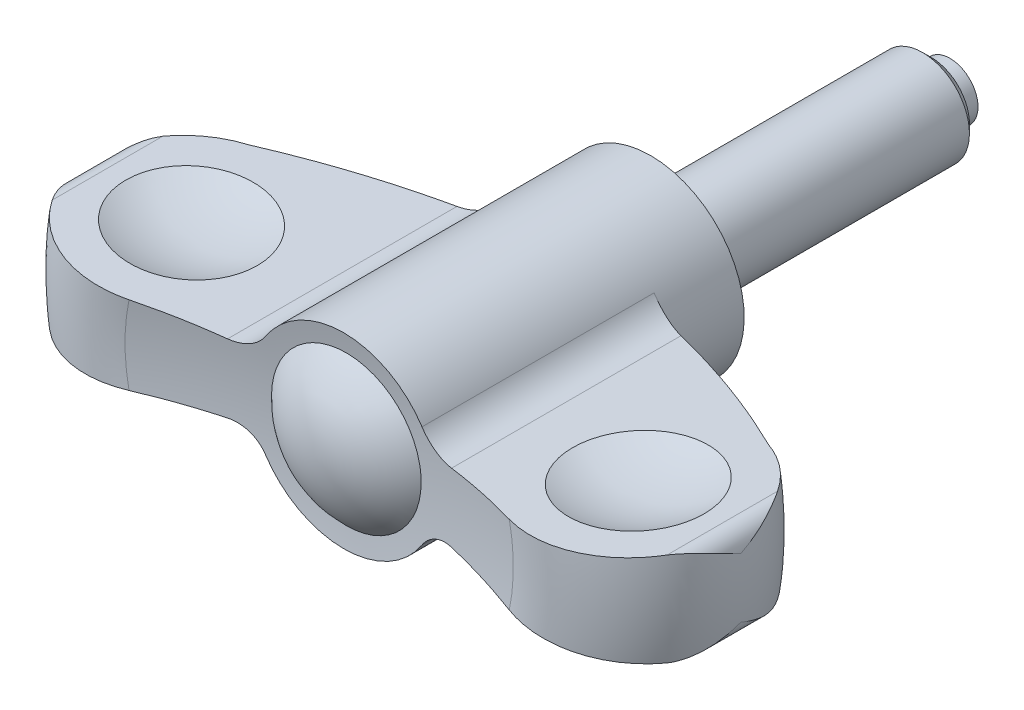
ISO-10303-21;
HEADER;
FILE_DESCRIPTION(('STEP AP214'),'2;1');
FILE_NAME('part.step','',(''),(''),'','','');
FILE_SCHEMA(('AUTOMOTIVE_DESIGN { 1 0 10303 214 1 1 1 1 }'));
ENDSEC;
DATA;
#1=APPLICATION_CONTEXT('core data for automotive mechanical design processes');
#2=APPLICATION_PROTOCOL_DEFINITION('international standard','automotive_design',2000,#1);
#3=PRODUCT_CONTEXT('',#1,'mechanical');
#4=PRODUCT('Part','Part','',(#3));
#5=PRODUCT_RELATED_PRODUCT_CATEGORY('part','',(#4));
#6=PRODUCT_DEFINITION_FORMATION('','',#4);
#7=PRODUCT_DEFINITION_CONTEXT('part definition',#1,'design');
#8=PRODUCT_DEFINITION('design','',#6,#7);
#9=PRODUCT_DEFINITION_SHAPE('','',#8);
#10=(LENGTH_UNIT() NAMED_UNIT(*) SI_UNIT(.MILLI.,.METRE.));
#11=(NAMED_UNIT(*) PLANE_ANGLE_UNIT() SI_UNIT($,.RADIAN.));
#12=(NAMED_UNIT(*) SI_UNIT($,.STERADIAN.) SOLID_ANGLE_UNIT());
#13=UNCERTAINTY_MEASURE_WITH_UNIT(LENGTH_MEASURE(1.E-05),#10,'distance_accuracy_value','');
#14=(GEOMETRIC_REPRESENTATION_CONTEXT(3) GLOBAL_UNCERTAINTY_ASSIGNED_CONTEXT((#13)) GLOBAL_UNIT_ASSIGNED_CONTEXT((#10,
#11,#12)) REPRESENTATION_CONTEXT('',''));
#15=CARTESIAN_POINT('',(0.,0.,0.));
#16=DIRECTION('',(0.,0.,1.));
#17=DIRECTION('',(1.,0.,0.));
#18=AXIS2_PLACEMENT_3D('',#15,#16,#17);
#19=CARTESIAN_POINT('',(0.,0.,94.3779064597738));
#20=DIRECTION('',(0.,0.,-1.));
#21=DIRECTION('',(0.,1.,0.));
#22=AXIS2_PLACEMENT_3D('',#19,#20,#21);
#23=DEGENERATE_TOROIDAL_SURFACE('',#22,13.5323057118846,89.5260416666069,.F.);
#24=CARTESIAN_POINT('',(11.974701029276,3.66644663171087,8.72739110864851));
#25=CARTESIAN_POINT('',(11.8626845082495,3.65928084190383,8.69417121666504));
#26=CARTESIAN_POINT('',(11.7501999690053,3.65683705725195,8.66148506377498));
#27=CARTESIAN_POINT('',(11.5250251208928,3.66146055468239,8.59744040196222));
#28=CARTESIAN_POINT('',(11.4123347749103,3.66852976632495,8.56608216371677));
#29=CARTESIAN_POINT('',(11.1873555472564,3.69226711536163,8.50492122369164));
#30=CARTESIAN_POINT('',(11.0750675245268,3.70894967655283,8.47512093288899));
#31=CARTESIAN_POINT('',(10.8518573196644,3.75192268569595,8.4174113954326));
#32=CARTESIAN_POINT('',(10.7409350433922,3.77821246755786,8.3895020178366));
#33=CARTESIAN_POINT('',(10.5209960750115,3.84041444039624,8.33580035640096));
#34=CARTESIAN_POINT('',(10.411984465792,3.87634906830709,8.31001319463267));
#35=CARTESIAN_POINT('',(10.1969726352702,3.95767948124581,8.2609301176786));
#36=CARTESIAN_POINT('',(10.0909722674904,4.0030748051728,8.2376340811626));
#37=CARTESIAN_POINT('',(9.88296652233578,4.10304797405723,8.19386124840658));
#38=CARTESIAN_POINT('',(9.78095589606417,4.15761321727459,8.17338065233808));
#39=CARTESIAN_POINT('',(9.58168184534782,4.27563508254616,8.13550071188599));
#40=CARTESIAN_POINT('',(9.48441603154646,4.3390871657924,8.11809980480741));
#41=CARTESIAN_POINT('',(9.2904965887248,4.47803359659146,8.08581609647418));
#42=CARTESIAN_POINT('',(9.1941384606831,4.55398290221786,8.07111155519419));
#43=CARTESIAN_POINT('',(9.00851292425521,4.71470710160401,8.04566935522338));
#44=CARTESIAN_POINT('',(8.91924567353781,4.79948219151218,8.03493178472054));
#45=CARTESIAN_POINT('',(8.74817455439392,4.9777034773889,8.01758669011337));
#46=CARTESIAN_POINT('',(8.66642211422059,5.07120170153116,8.01100604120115));
#47=CARTESIAN_POINT('',(8.51183266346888,5.26553635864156,8.00220235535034));
#48=CARTESIAN_POINT('',(8.43899852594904,5.36637513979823,7.99998071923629));
#49=CARTESIAN_POINT('',(8.37105193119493,5.47041952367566,8.00000000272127));
#50=B_SPLINE_CURVE_WITH_KNOTS('',3,(#24,#25,#26,#27,#28,#29,#30,#31,#32,#33,#34,#35,#36,#37,#38,
#39,#40,#41,#42,#43,#44,#45,#46,#47,#48,#49),.UNSPECIFIED.,.F.,.F.,(4,2,2,2,2,2,2,2,2,2,2,2,4),
(0.,0.351089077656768,0.702249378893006,1.0539379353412,1.40560211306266,1.75809157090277,
2.1105638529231,2.4625556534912,2.81436833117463,3.1844969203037,3.55463373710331,
3.92713969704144,4.29976534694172),.UNSPECIFIED.);
#51=CARTESIAN_POINT('',(11.974501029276,3.6664338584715,8.72733179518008));
#52=VERTEX_POINT('',#51);
#53=CARTESIAN_POINT('',(8.3711826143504,5.4702195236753,8.));
#54=VERTEX_POINT('',#53);
#55=EDGE_CURVE('E156',#52,#54,#50,.T.);
#56=ORIENTED_EDGE('',*,*,#55,.F.);
#57=CARTESIAN_POINT('',(27.7672650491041,4.67466039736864,15.151460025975));
#58=CARTESIAN_POINT('',(26.5054831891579,4.59410692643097,14.4896578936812));
#59=CARTESIAN_POINT('',(25.2277137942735,4.51253279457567,13.8582020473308));
#60=CARTESIAN_POINT('',(22.6463384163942,4.34773509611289,12.6591020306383));
#61=CARTESIAN_POINT('',(21.3428000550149,4.26451584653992,12.0913116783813));
#62=CARTESIAN_POINT('',(19.3681856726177,4.13845440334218,11.2874548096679));
#63=CARTESIAN_POINT('',(18.706726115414,4.0962261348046,11.0274609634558));
#64=CARTESIAN_POINT('',(17.3776947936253,4.01137938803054,10.5236280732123));
#65=CARTESIAN_POINT('',(16.710123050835,3.96876091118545,10.2797889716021));
#66=CARTESIAN_POINT('',(15.3676631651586,3.88305687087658,9.80796285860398));
#67=CARTESIAN_POINT('',(14.6927615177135,3.83997044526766,9.58001443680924));
#68=CARTESIAN_POINT('',(13.3375216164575,3.75345051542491,9.14094002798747));
#69=CARTESIAN_POINT('',(12.6571832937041,3.71001700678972,8.92981425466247));
#70=CARTESIAN_POINT('',(11.974301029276,3.66642109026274,8.72727248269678));
#71=B_SPLINE_CURVE_WITH_KNOTS('',3,(#57,#58,#59,#60,#61,#62,#63,#64,#65,#66,#67,#68,#69,#70),
.UNSPECIFIED.,.F.,.F.,(4,2,2,2,2,2,4),(0.,4.28107090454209,8.55210157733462,10.6878521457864,
12.823595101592,14.964355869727,17.1051438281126),.UNSPECIFIED.);
#72=CARTESIAN_POINT('',(27.7668837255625,4.67463605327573,15.151260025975));
#73=VERTEX_POINT('',#72);
#74=EDGE_CURVE('E201',#73,#52,#71,.T.);
#75=ORIENTED_EDGE('',*,*,#74,.F.);
#76=CARTESIAN_POINT('',(0.,0.,15.1512600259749));
#77=DIRECTION('',(0.,0.,-1.));
#78=DIRECTION('',(0.,1.,0.));
#79=AXIS2_PLACEMENT_3D('',#76,#77,#78);
#80=CIRCLE('',#79,28.1576287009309);
#81=CARTESIAN_POINT('',(27.7668837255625,-4.67463605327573,15.151260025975));
#82=VERTEX_POINT('',#81);
#83=EDGE_CURVE('E469',#73,#82,#80,.T.);
#84=ORIENTED_EDGE('',*,*,#83,.T.);
#85=CARTESIAN_POINT('',(11.974301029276,-3.66642109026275,8.72727248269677));
#86=CARTESIAN_POINT('',(12.4874096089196,-3.69917847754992,8.87944979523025));
#87=CARTESIAN_POINT('',(12.9990691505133,-3.73184335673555,9.03648048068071));
#88=CARTESIAN_POINT('',(14.0193683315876,-3.79698032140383,9.36009281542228));
#89=CARTESIAN_POINT('',(14.5280079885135,-3.82945240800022,9.52667440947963));
#90=CARTESIAN_POINT('',(16.0492634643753,-3.92657094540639,10.0405281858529));
#91=CARTESIAN_POINT('',(17.0571750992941,-3.99091707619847,10.4018972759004));
#92=CARTESIAN_POINT('',(19.0556157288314,-4.11849961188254,11.1599495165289));
#93=CARTESIAN_POINT('',(20.046193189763,-4.18173911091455,11.5565047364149));
#94=CARTESIAN_POINT('',(22.0122940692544,-4.30725704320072,12.385252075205));
#95=CARTESIAN_POINT('',(22.98781901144,-4.36953557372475,12.8174405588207));
#96=CARTESIAN_POINT('',(24.5975778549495,-4.47230425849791,13.5656862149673));
#97=CARTESIAN_POINT('',(25.2363554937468,-4.51308448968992,13.8719727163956));
#98=CARTESIAN_POINT('',(26.507156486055,-4.5942137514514,14.500135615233));
#99=CARTESIAN_POINT('',(27.1391710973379,-4.63456222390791,14.8220297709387));
#100=CARTESIAN_POINT('',(27.7672650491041,-4.67466039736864,15.151460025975));
#101=B_SPLINE_CURVE_WITH_KNOTS('',3,(#85,#86,#87,#88,#89,#90,#91,#92,#93,#94,#95,#96,#97,#98,
#99,#100),.UNSPECIFIED.,.F.,.F.,(4,2,2,2,2,2,2,4),(0.,1.60855024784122,3.21709119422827,
6.43430058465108,9.64025784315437,12.8458884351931,14.9744558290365,17.1055046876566),.UNSPECIFIED.);
#102=CARTESIAN_POINT('',(11.974501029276,-3.6664338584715,8.72733179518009));
#103=VERTEX_POINT('',#102);
#104=EDGE_CURVE('E262',#103,#82,#101,.T.);
#105=ORIENTED_EDGE('',*,*,#104,.F.);
#106=CARTESIAN_POINT('',(8.37105193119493,-5.47041952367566,8.00000000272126));
#107=CARTESIAN_POINT('',(8.42987619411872,-5.38036132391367,7.99998867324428));
#108=CARTESIAN_POINT('',(8.49235251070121,-5.29269899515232,8.0016498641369));
#109=CARTESIAN_POINT('',(8.62407576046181,-5.1227780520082,8.00825013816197));
#110=CARTESIAN_POINT('',(8.69332125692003,-5.04051829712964,8.01318852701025));
#111=CARTESIAN_POINT('',(8.83786319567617,-4.88220751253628,8.02625697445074));
#112=CARTESIAN_POINT('',(8.91314136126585,-4.80613903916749,8.03437766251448));
#113=CARTESIAN_POINT('',(9.06930832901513,-4.66046185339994,8.05367779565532));
#114=CARTESIAN_POINT('',(9.15019723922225,-4.59085326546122,8.06485729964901));
#115=CARTESIAN_POINT('',(9.40031010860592,-4.39245366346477,8.1027467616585));
#116=CARTESIAN_POINT('',(9.57716938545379,-4.27388252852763,8.13382523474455));
#117=CARTESIAN_POINT('',(9.94584435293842,-4.06687280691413,8.20600408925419));
#118=CARTESIAN_POINT('',(10.13767168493,-3.97845796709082,8.24711232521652));
#119=CARTESIAN_POINT('',(10.5372676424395,-3.83094076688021,8.33894932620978));
#120=CARTESIAN_POINT('',(10.745348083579,-3.77284952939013,8.38994035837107));
#121=CARTESIAN_POINT('',(11.1662642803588,-3.69098626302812,8.4986354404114));
#122=CARTESIAN_POINT('',(11.3790944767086,-3.66717605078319,8.55633194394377));
#123=CARTESIAN_POINT('',(11.6555725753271,-3.65830502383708,8.63450176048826));
#124=CARTESIAN_POINT('',(11.7195886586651,-3.65779498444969,8.65282658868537));
#125=CARTESIAN_POINT('',(11.8473452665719,-3.6598377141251,8.68983862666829));
#126=CARTESIAN_POINT('',(11.9110860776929,-3.66238510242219,8.70852514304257));
#127=CARTESIAN_POINT('',(11.974701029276,-3.66644663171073,8.72739110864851));
#128=B_SPLINE_CURVE_WITH_KNOTS('',3,(#106,#107,#108,#109,#110,#111,#112,#113,#114,#115,#116,
#117,#118,#119,#120,#121,#122,#123,#124,#125,#126,#127),.UNSPECIFIED.,.F.,.F.,(4,2,2,2,2,2,2,2,
2,2,4),(0.,0.322587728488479,0.645107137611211,0.966683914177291,1.28826688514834,
1.93060210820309,2.57344198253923,3.23653223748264,3.89888334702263,4.09860313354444,
4.29797194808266),.UNSPECIFIED.);
#129=CARTESIAN_POINT('',(8.3711826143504,-5.4702195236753,8.));
#130=VERTEX_POINT('',#129);
#131=EDGE_CURVE('E254',#130,#103,#128,.T.);
#132=ORIENTED_EDGE('',*,*,#131,.F.);
#133=CARTESIAN_POINT('',(0.,0.,8.));
#134=DIRECTION('',(0.,0.,-1.));
#135=DIRECTION('',(0.,1.,0.));
#136=AXIS2_PLACEMENT_3D('',#133,#134,#135);
#137=CIRCLE('',#136,10.);
#138=EDGE_CURVE('E462',#54,#130,#137,.T.);
#139=ORIENTED_EDGE('',*,*,#138,.F.);
#140=EDGE_LOOP('',(#56,#75,#84,#105,#132,#139));
#141=FACE_BOUND('',#140,.T.);
#142=ADVANCED_FACE('F14',(#141),#23,.F.);
#143=CARTESIAN_POINT('',(0.,0.,25.2));
#144=DIRECTION('',(0.,0.,-1.));
#145=DIRECTION('',(0.,1.,0.));
#146=AXIS2_PLACEMENT_3D('',#143,#144,#145);
#147=TOROIDAL_SURFACE('',#146,24.1999999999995,10.8000000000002);
#148=CARTESIAN_POINT('',(19.8094271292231,4.1666237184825,15.1510600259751));
#149=CARTESIAN_POINT('',(19.521941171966,4.14827031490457,15.2632988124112));
#150=CARTESIAN_POINT('',(19.2391962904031,4.13021958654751,15.3877140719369));
#151=CARTESIAN_POINT('',(18.6851350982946,4.09484774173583,15.6598852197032));
#152=CARTESIAN_POINT('',(18.4138184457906,4.07752660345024,15.807640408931));
#153=CARTESIAN_POINT('',(17.8845989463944,4.04374067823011,16.1254521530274));
#154=CARTESIAN_POINT('',(17.6266932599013,4.02727571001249,16.2955039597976));
#155=CARTESIAN_POINT('',(17.1260724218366,3.99531555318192,16.6567393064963));
#156=CARTESIAN_POINT('',(16.8833570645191,3.97982035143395,16.8479225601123));
#157=CARTESIAN_POINT('',(16.4147337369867,3.94990294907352,17.2502188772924));
#158=CARTESIAN_POINT('',(16.1888353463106,3.93548136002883,17.4613431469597));
#159=CARTESIAN_POINT('',(15.755661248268,3.90782707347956,17.9019729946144));
#160=CARTESIAN_POINT('',(15.5483853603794,3.89459436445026,18.1314783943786));
#161=CARTESIAN_POINT('',(15.1540682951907,3.86942075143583,18.6072254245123));
#162=CARTESIAN_POINT('',(14.9670217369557,3.85747950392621,18.8534625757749));
#163=CARTESIAN_POINT('',(14.6145533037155,3.83497755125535,19.3610162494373));
#164=CARTESIAN_POINT('',(14.4491311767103,3.82441683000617,19.6223325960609));
#165=CARTESIAN_POINT('',(14.1423037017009,3.80482864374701,20.1563589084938));
#166=CARTESIAN_POINT('',(14.0007403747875,3.79579109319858,20.4289777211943));
#167=CARTESIAN_POINT('',(13.7414172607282,3.77923563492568,20.9853603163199));
#168=CARTESIAN_POINT('',(13.6236574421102,3.771717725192,21.2691240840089));
#169=CARTESIAN_POINT('',(13.4129494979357,3.75826591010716,21.8457675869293));
#170=CARTESIAN_POINT('',(13.3200020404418,3.75233204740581,22.138647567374));
#171=CARTESIAN_POINT('',(13.1597528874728,3.74210157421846,22.7313695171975));
#172=CARTESIAN_POINT('',(13.09245072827,3.73780493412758,23.0312113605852));
#173=CARTESIAN_POINT('',(12.9852187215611,3.7309591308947,23.6294343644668));
#174=CARTESIAN_POINT('',(12.9447569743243,3.72837601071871,23.9277198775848));
#175=CARTESIAN_POINT('',(12.889397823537,3.72484182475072,24.5266624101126));
#176=CARTESIAN_POINT('',(12.8745000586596,3.72389073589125,24.8273193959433));
#177=CARTESIAN_POINT('',(12.8704051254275,3.72362931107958,25.4287668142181));
#178=CARTESIAN_POINT('',(12.8812044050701,3.72431874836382,25.7295572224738));
#179=CARTESIAN_POINT('',(12.9283972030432,3.72733158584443,26.329113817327));
#180=CARTESIAN_POINT('',(12.9647906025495,3.72965497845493,26.6278800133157));
#181=CARTESIAN_POINT('',(13.0621879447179,3.73587292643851,27.2172682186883));
#182=CARTESIAN_POINT('',(13.1228581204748,3.73974617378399,27.5079456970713));
#183=CARTESIAN_POINT('',(13.2682686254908,3.74902933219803,28.083185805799));
#184=CARTESIAN_POINT('',(13.3530086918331,3.75443922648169,28.3677485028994));
#185=CARTESIAN_POINT('',(13.5458552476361,3.76675075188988,28.9288272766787));
#186=CARTESIAN_POINT('',(13.6539633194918,3.77365248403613,29.2053428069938));
#187=CARTESIAN_POINT('',(13.892668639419,3.78889168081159,29.7484482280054));
#188=CARTESIAN_POINT('',(14.0232661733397,3.79722916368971,30.0150379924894));
#189=CARTESIAN_POINT('',(14.3074636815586,3.81537262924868,30.5393506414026));
#190=CARTESIAN_POINT('',(14.4612972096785,3.82519352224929,30.7969464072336));
#191=CARTESIAN_POINT('',(14.7897260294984,3.84616076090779,31.2984830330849));
#192=CARTESIAN_POINT('',(14.964321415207,3.85730711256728,31.542423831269));
#193=CARTESIAN_POINT('',(15.332994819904,3.88084360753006,32.0150649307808));
#194=CARTESIAN_POINT('',(15.5270739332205,3.8932338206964,32.243764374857));
#195=CARTESIAN_POINT('',(15.9333227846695,3.91916917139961,32.6844276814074));
#196=CARTESIAN_POINT('',(16.1454932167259,3.93271435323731,32.8963909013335));
#197=CARTESIAN_POINT('',(16.5910171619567,3.96115706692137,33.3064124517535));
#198=CARTESIAN_POINT('',(16.8247188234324,3.97607682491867,33.5040910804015));
#199=CARTESIAN_POINT('',(17.3077586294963,4.0069145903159,33.8792342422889));
#200=CARTESIAN_POINT('',(17.5570969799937,4.0228326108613,34.0566985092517));
#201=CARTESIAN_POINT('',(18.0696721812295,4.05555594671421,34.3902150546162));
#202=CARTESIAN_POINT('',(18.3329099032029,4.07236131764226,34.546265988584));
#203=CARTESIAN_POINT('',(18.8714293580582,4.10674096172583,34.8358677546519));
#204=CARTESIAN_POINT('',(19.1467108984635,4.12431522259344,34.9694189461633));
#205=CARTESIAN_POINT('',(19.710494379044,4.16030774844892,35.2144334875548));
#206=CARTESIAN_POINT('',(19.9991082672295,4.1787331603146,35.3256382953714));
#207=CARTESIAN_POINT('',(20.5846589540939,4.216115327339,35.5232991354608));
#208=CARTESIAN_POINT('',(20.8815958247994,4.23507208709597,35.609754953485));
#209=CARTESIAN_POINT('',(21.4816933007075,4.27338293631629,35.7572774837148));
#210=CARTESIAN_POINT('',(21.7848540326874,4.29273703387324,35.8183436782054));
#211=CARTESIAN_POINT('',(22.3952378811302,4.33170457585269,35.9146144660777));
#212=CARTESIAN_POINT('',(22.7024609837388,4.35131801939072,35.9498191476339));
#213=CARTESIAN_POINT('',(23.3185771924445,4.39065152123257,35.9940613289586));
#214=CARTESIAN_POINT('',(23.6274690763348,4.41037150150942,36.0031159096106));
#215=CARTESIAN_POINT('',(24.2449112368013,4.44978965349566,35.9949986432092));
#216=CARTESIAN_POINT('',(24.5534615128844,4.46948782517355,35.9778267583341));
#217=CARTESIAN_POINT('',(25.1679638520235,4.50871829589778,35.9173391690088));
#218=CARTESIAN_POINT('',(25.4739162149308,4.52825061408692,35.87402652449));
#219=CARTESIAN_POINT('',(26.0810457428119,4.56701039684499,35.7615284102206));
#220=CARTESIAN_POINT('',(26.3822229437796,4.58623786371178,35.692343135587));
#221=CARTESIAN_POINT('',(26.9757928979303,4.62413198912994,35.5290595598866));
#222=CARTESIAN_POINT('',(27.2682281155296,4.64280135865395,35.4351162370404));
#223=CARTESIAN_POINT('',(27.8441179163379,4.67956676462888,35.2227578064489));
#224=CARTESIAN_POINT('',(28.1275723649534,4.69766279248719,35.1043423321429));
#225=CARTESIAN_POINT('',(28.6835841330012,4.73315916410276,34.8437895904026));
#226=CARTESIAN_POINT('',(28.9561358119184,4.75055914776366,34.7016402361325));
#227=CARTESIAN_POINT('',(29.4881932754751,4.78452625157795,34.3946618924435));
#228=CARTESIAN_POINT('',(29.7476996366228,4.80109340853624,34.2298339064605));
#229=CARTESIAN_POINT('',(30.2504147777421,4.83318726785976,33.8796120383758));
#230=CARTESIAN_POINT('',(30.4937042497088,4.84871912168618,33.6943344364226));
#231=CARTESIAN_POINT('',(30.9637439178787,4.87872694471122,33.3038019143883));
#232=CARTESIAN_POINT('',(31.1904947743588,4.89320295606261,33.0985477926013));
#233=CARTESIAN_POINT('',(31.625376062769,4.92096623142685,32.6699535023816));
#234=CARTESIAN_POINT('',(31.8335423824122,4.93425578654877,32.4466498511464));
#235=CARTESIAN_POINT('',(32.2301600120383,4.95957626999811,31.9832771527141));
#236=CARTESIAN_POINT('',(32.4186239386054,4.97160800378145,31.743219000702));
#237=CARTESIAN_POINT('',(32.6424762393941,4.98589896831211,31.4317807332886));
#238=CARTESIAN_POINT('',(32.6877085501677,4.98878664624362,31.3673743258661));
#239=CARTESIAN_POINT('',(32.776715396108,4.99446893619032,31.2376428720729));
#240=CARTESIAN_POINT('',(32.820491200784,4.99726362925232,31.1723187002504));
#241=CARTESIAN_POINT('',(32.86355345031,5.00001276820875,31.1065166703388));
#242=B_SPLINE_CURVE_WITH_KNOTS('',3,(#148,#149,#150,#151,#152,#153,#154,#155,#156,#157,#158,
#159,#160,#161,#162,#163,#164,#165,#166,#167,#168,#169,#170,#171,#172,#173,#174,#175,#176,#177,
#178,#179,#180,#181,#182,#183,#184,#185,#186,#187,#188,#189,#190,#191,#192,#193,#194,#195,#196,
#197,#198,#199,#200,#201,#202,#203,#204,#205,#206,#207,#208,#209,#210,#211,#212,#213,#214,#215,
#216,#217,#218,#219,#220,#221,#222,#223,#224,#225,#226,#227,#228,#229,#230,#231,#232,#233,#234,
#235,#236,#237,#238,#239,#240,#241),.UNSPECIFIED.,.F.,.F.,(4,2,2,2,2,2,2,2,2,2,2,2,2,2,2,2,2,2,
2,2,2,2,2,2,2,2,2,2,2,2,2,2,2,2,2,2,2,2,2,2,2,2,2,2,2,2,4),(0.,0.927211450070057,
1.85439513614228,2.78138169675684,3.70835569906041,4.63585376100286,5.56334283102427,
6.49058458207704,7.41781552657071,8.3386426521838,9.2594685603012,10.1803192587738,
11.1011533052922,12.0031457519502,12.9051254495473,13.8069804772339,14.7088313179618,
15.5986872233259,16.4885334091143,17.3784398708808,18.2683576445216,19.1679024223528,
20.0674512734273,20.9670506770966,21.8666846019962,22.7849824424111,23.7032923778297,
24.6216599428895,25.5400128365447,26.4684461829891,27.3968875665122,28.325347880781,
29.25380502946,30.1816555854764,31.1095074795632,32.0372507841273,32.9649870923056,
33.8870485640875,34.8091238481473,35.7316701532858,36.6541756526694,37.5716823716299,
38.4891524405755,39.4048106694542,40.3198789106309,40.5561351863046,40.7921798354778),.UNSPECIFIED.);
#243=CARTESIAN_POINT('',(20.3283313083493,4.19975110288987,35.436701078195));
#244=VERTEX_POINT('',#243);
#245=CARTESIAN_POINT('',(32.86335345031,5.,31.1068222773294));
#246=VERTEX_POINT('',#245);
#247=EDGE_CURVE('E270',#244,#246,#242,.T.);
#248=ORIENTED_EDGE('',*,*,#247,.F.);
#249=CARTESIAN_POINT('',(0.,0.,35.436701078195));
#250=DIRECTION('',(0.,0.,-1.));
#251=DIRECTION('',(0.,1.,0.));
#252=AXIS2_PLACEMENT_3D('',#249,#250,#251);
#253=CIRCLE('',#252,20.757624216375);
#254=CARTESIAN_POINT('',(20.3283313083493,-4.19975110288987,35.436701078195));
#255=VERTEX_POINT('',#254);
#256=EDGE_CURVE('E207',#244,#255,#253,.T.);
#257=ORIENTED_EDGE('',*,*,#256,.T.);
#258=CARTESIAN_POINT('',(32.86355345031,-5.00001276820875,31.1065166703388));
#259=CARTESIAN_POINT('',(32.6970155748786,-4.98938081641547,31.3610626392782));
#260=CARTESIAN_POINT('',(32.5196781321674,-4.97805940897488,31.6085043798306));
#261=CARTESIAN_POINT('',(32.1448146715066,-4.95412773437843,32.0874989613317));
#262=CARTESIAN_POINT('',(31.9472900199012,-4.94151755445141,32.319052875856));
#263=CARTESIAN_POINT('',(31.533625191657,-4.91510876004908,32.7644266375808));
#264=CARTESIAN_POINT('',(31.3175018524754,-4.90131122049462,32.978262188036));
#265=CARTESIAN_POINT('',(30.8680530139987,-4.87261793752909,33.386932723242));
#266=CARTESIAN_POINT('',(30.6347276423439,-4.85772220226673,33.5817678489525));
#267=CARTESIAN_POINT('',(30.1524568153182,-4.82693352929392,33.9511443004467));
#268=CARTESIAN_POINT('',(29.9035056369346,-4.81104022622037,34.1256781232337));
#269=CARTESIAN_POINT('',(29.3918426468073,-4.77837512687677,34.4531585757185));
#270=CARTESIAN_POINT('',(29.1291307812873,-4.76160332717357,34.6061051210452));
#271=CARTESIAN_POINT('',(28.5918605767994,-4.72730343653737,34.8893375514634));
#272=CARTESIAN_POINT('',(28.317303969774,-4.70977545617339,35.0196267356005));
#273=CARTESIAN_POINT('',(27.7582600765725,-4.67408551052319,35.256686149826));
#274=CARTESIAN_POINT('',(27.4737728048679,-4.65592354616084,35.3634564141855));
#275=CARTESIAN_POINT('',(26.8959018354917,-4.61903166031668,35.5530849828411));
#276=CARTESIAN_POINT('',(26.6024912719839,-4.60030002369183,35.6358610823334));
#277=CARTESIAN_POINT('',(26.0097777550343,-4.56246057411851,35.7764716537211));
#278=CARTESIAN_POINT('',(25.7104747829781,-4.54335275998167,35.8343060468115));
#279=CARTESIAN_POINT('',(25.1080405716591,-4.50489273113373,35.9246751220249));
#280=CARTESIAN_POINT('',(24.804908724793,-4.48554047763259,35.957205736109));
#281=CARTESIAN_POINT('',(24.1969928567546,-4.44673049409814,35.9967664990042));
#282=CARTESIAN_POINT('',(23.8922088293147,-4.4272727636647,36.0037965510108));
#283=CARTESIAN_POINT('',(23.2812746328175,-4.38827008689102,35.9923141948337));
#284=CARTESIAN_POINT('',(22.9751273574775,-4.36872532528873,35.9736469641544));
#285=CARTESIAN_POINT('',(22.3654717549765,-4.32980427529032,35.910667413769));
#286=CARTESIAN_POINT('',(22.0619634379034,-4.31042798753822,35.8663549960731));
#287=CARTESIAN_POINT('',(21.4597220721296,-4.27198027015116,35.752435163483));
#288=CARTESIAN_POINT('',(21.1609888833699,-4.25290883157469,35.6828284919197));
#289=CARTESIAN_POINT('',(20.5703741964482,-4.21520337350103,35.5188386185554));
#290=CARTESIAN_POINT('',(20.2784927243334,-4.19656935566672,35.4244553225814));
#291=CARTESIAN_POINT('',(19.7018002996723,-4.15975270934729,35.2109220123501));
#292=CARTESIAN_POINT('',(19.4170455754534,-4.14157367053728,35.0916194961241));
#293=CARTESIAN_POINT('',(18.8585419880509,-4.10591821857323,34.8294691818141));
#294=CARTESIAN_POINT('',(18.5847931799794,-4.08844180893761,34.6866212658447));
#295=CARTESIAN_POINT('',(18.0502819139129,-4.05431805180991,34.3784131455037));
#296=CARTESIAN_POINT('',(17.7895173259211,-4.0376705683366,34.2130566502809));
#297=CARTESIAN_POINT('',(17.2826654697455,-4.00531261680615,33.8608847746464));
#298=CARTESIAN_POINT('',(17.0365849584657,-3.98960258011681,33.6740596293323));
#299=CARTESIAN_POINT('',(16.5603945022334,-3.9592020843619,33.2798000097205));
#300=CARTESIAN_POINT('',(16.3303268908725,-3.94451432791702,33.0723141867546));
#301=CARTESIAN_POINT('',(15.88864842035,-3.9163171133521,32.6386690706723));
#302=CARTESIAN_POINT('',(15.6770290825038,-3.90280711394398,32.4125184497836));
#303=CARTESIAN_POINT('',(15.273673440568,-3.87705646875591,31.942972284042));
#304=CARTESIAN_POINT('',(15.0819415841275,-3.86481610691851,31.6995729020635));
#305=CARTESIAN_POINT('',(14.7199002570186,-3.84170301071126,31.1972686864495));
#306=CARTESIAN_POINT('',(14.5495906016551,-3.83083026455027,30.938363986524));
#307=CARTESIAN_POINT('',(14.2330366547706,-3.8106211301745,30.4090093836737));
#308=CARTESIAN_POINT('',(14.0866097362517,-3.80127308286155,30.1386691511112));
#309=CARTESIAN_POINT('',(13.8173755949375,-3.78408489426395,29.5864219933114));
#310=CARTESIAN_POINT('',(13.6945682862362,-3.77624474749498,29.3045151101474));
#311=CARTESIAN_POINT('',(13.4736346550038,-3.76214011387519,28.7311892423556));
#312=CARTESIAN_POINT('',(13.3755052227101,-3.75587542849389,28.4397714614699));
#313=CARTESIAN_POINT('',(13.2047780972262,-3.74497603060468,27.8495203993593));
#314=CARTESIAN_POINT('',(13.1321799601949,-3.74034128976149,27.5506872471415));
#315=CARTESIAN_POINT('',(13.0143769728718,-3.73282062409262,26.9538991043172));
#316=CARTESIAN_POINT('',(12.9686502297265,-3.72990138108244,26.6560474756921));
#317=CARTESIAN_POINT('',(12.9027598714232,-3.72569487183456,26.0575192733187));
#318=CARTESIAN_POINT('',(12.8825958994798,-3.72440758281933,25.7568427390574));
#319=CARTESIAN_POINT('',(12.8680159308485,-3.7234767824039,25.1548864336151));
#320=CARTESIAN_POINT('',(12.8735980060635,-3.72383314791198,24.8536067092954));
#321=CARTESIAN_POINT('',(12.9104544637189,-3.72618610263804,24.2526307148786));
#322=CARTESIAN_POINT('',(12.9417287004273,-3.72818268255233,23.9529344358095));
#323=CARTESIAN_POINT('',(13.0290553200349,-3.7337577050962,23.3615637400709));
#324=CARTESIAN_POINT('',(13.0847478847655,-3.73731317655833,23.0698358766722));
#325=CARTESIAN_POINT('',(13.2203342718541,-3.74596915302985,22.4920881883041));
#326=CARTESIAN_POINT('',(13.3002278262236,-3.75106964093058,22.2060683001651));
#327=CARTESIAN_POINT('',(13.4835377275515,-3.76277233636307,21.641717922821));
#328=CARTESIAN_POINT('',(13.5869530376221,-3.76937447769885,21.3633870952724));
#329=CARTESIAN_POINT('',(13.8164657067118,-3.78402680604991,20.8162811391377));
#330=CARTESIAN_POINT('',(13.9425632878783,-3.79207700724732,20.5475061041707));
#331=CARTESIAN_POINT('',(14.2177511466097,-3.80964528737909,20.018798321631));
#332=CARTESIAN_POINT('',(14.3670482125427,-3.81917656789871,19.7589736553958));
#333=CARTESIAN_POINT('',(14.6866052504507,-3.83957742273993,19.2525984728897));
#334=CARTESIAN_POINT('',(14.8568660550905,-3.85044705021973,19.0060484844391));
#335=CARTESIAN_POINT('',(15.2171824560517,-3.8734500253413,18.527716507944));
#336=CARTESIAN_POINT('',(15.4072489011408,-3.88558406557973,18.2959427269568));
#337=CARTESIAN_POINT('',(15.8057255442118,-3.91102323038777,17.8488248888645));
#338=CARTESIAN_POINT('',(16.0141353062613,-3.924328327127,17.6334804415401));
#339=CARTESIAN_POINT('',(16.4525588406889,-3.95231774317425,17.2161199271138));
#340=CARTESIAN_POINT('',(16.682943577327,-3.96702574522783,17.0144950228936));
#341=CARTESIAN_POINT('',(17.1596933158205,-3.99746194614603,16.6312115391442));
#342=CARTESIAN_POINT('',(17.4060580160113,-4.01319012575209,16.449552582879));
#343=CARTESIAN_POINT('',(17.9125776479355,-4.04552686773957,16.1077341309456));
#344=CARTESIAN_POINT('',(18.1727078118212,-4.06213384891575,15.9475377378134));
#345=CARTESIAN_POINT('',(18.7052437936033,-4.09613150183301,15.6494302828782));
#346=CARTESIAN_POINT('',(18.977642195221,-4.11352170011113,15.511505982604));
#347=CARTESIAN_POINT('',(19.3465341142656,-4.13707214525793,15.3436217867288));
#348=CARTESIAN_POINT('',(19.4384317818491,-4.14293898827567,15.3033100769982));
#349=CARTESIAN_POINT('',(19.6231938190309,-4.15473438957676,15.2252627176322));
#350=CARTESIAN_POINT('',(19.7160570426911,-4.16066287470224,15.1875243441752));
#351=CARTESIAN_POINT('',(19.8094271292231,-4.1666237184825,15.1510600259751));
#352=B_SPLINE_CURVE_WITH_KNOTS('',3,(#258,#259,#260,#261,#262,#263,#264,#265,#266,#267,#268,
#269,#270,#271,#272,#273,#274,#275,#276,#277,#278,#279,#280,#281,#282,#283,#284,#285,#286,#287,
#288,#289,#290,#291,#292,#293,#294,#295,#296,#297,#298,#299,#300,#301,#302,#303,#304,#305,#306,
#307,#308,#309,#310,#311,#312,#313,#314,#315,#316,#317,#318,#319,#320,#321,#322,#323,#324,#325,
#326,#327,#328,#329,#330,#331,#332,#333,#334,#335,#336,#337,#338,#339,#340,#341,#342,#343,#344,
#345,#346,#347,#348,#349,#350,#351),.UNSPECIFIED.,.F.,.F.,(4,2,2,2,2,2,2,2,2,2,2,2,2,2,2,2,2,2,
2,2,2,2,2,2,2,2,2,2,2,2,2,2,2,2,2,2,2,2,2,2,2,2,2,2,2,2,4),(0.,0.912828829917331,
1.8255959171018,2.73754519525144,3.64948770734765,4.5617661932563,5.47404824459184,
6.38619735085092,7.29834512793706,8.21358198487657,9.12882173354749,10.04420859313,
10.9595989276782,11.8805285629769,12.8014617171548,13.7223678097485,14.6432774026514,
15.569997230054,16.4967216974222,17.423293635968,18.3502887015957,19.2796480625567,
20.2085780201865,21.1377152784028,22.0668445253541,22.9884970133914,23.9101461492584,
24.8316790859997,25.7531960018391,26.6561671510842,27.559125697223,28.4620166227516,
29.3649024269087,30.2549087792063,31.1449052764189,32.0348625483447,32.9248285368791,
33.8232378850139,34.7216829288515,35.6206227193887,36.5195411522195,37.4379872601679,
38.3564160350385,39.2732450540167,40.1895270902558,40.4910655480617,40.792279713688),.UNSPECIFIED.);
#353=CARTESIAN_POINT('',(32.86335345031,-5.,31.1068222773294));
#354=VERTEX_POINT('',#353);
#355=EDGE_CURVE('E292',#354,#255,#352,.T.);
#356=ORIENTED_EDGE('',*,*,#355,.F.);
#357=CARTESIAN_POINT('',(34.8550718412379,-3.18181818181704,25.2));
#358=CARTESIAN_POINT('',(34.854816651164,-3.18461365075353,25.2063339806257));
#359=CARTESIAN_POINT('',(34.8545555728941,-3.18740861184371,25.2126680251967));
#360=CARTESIAN_POINT('',(34.8413131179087,-3.32602286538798,25.5268629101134));
#361=CARTESIAN_POINT('',(34.814430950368,-3.46059898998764,25.8348634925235));
#362=CARTESIAN_POINT('',(34.7331429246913,-3.72302915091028,26.4501493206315));
#363=CARTESIAN_POINT('',(34.678728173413,-3.8508810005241,26.7574343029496));
#364=CARTESIAN_POINT('',(34.5425422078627,-4.09540419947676,27.3704461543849));
#365=CARTESIAN_POINT('',(34.4607711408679,-4.21207560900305,27.6761730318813));
#366=CARTESIAN_POINT('',(34.2700177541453,-4.42903994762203,28.2849033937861));
#367=CARTESIAN_POINT('',(34.1610499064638,-4.52934154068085,28.5879082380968));
#368=CARTESIAN_POINT('',(33.9615538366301,-4.67422314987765,29.0782860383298));
#369=CARTESIAN_POINT('',(33.8791281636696,-4.7256866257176,29.2669483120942));
#370=CARTESIAN_POINT('',(33.7038328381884,-4.81752106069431,29.641969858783));
#371=CARTESIAN_POINT('',(33.6109712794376,-4.85790053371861,29.828330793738));
#372=CARTESIAN_POINT('',(33.4146279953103,-4.92533601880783,30.1990092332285));
#373=CARTESIAN_POINT('',(33.3111018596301,-4.9523333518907,30.3833143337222));
#374=CARTESIAN_POINT('',(33.148515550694,-4.98033159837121,30.6569567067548));
#375=CARTESIAN_POINT('',(33.0930344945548,-4.98758253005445,30.7478066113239));
#376=CARTESIAN_POINT('',(32.9797779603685,-4.99741570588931,30.9283687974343));
#377=CARTESIAN_POINT('',(32.9220015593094,-4.99999605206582,31.0180806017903));
#378=CARTESIAN_POINT('',(32.8631534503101,-4.99999999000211,31.1071249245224));
#379=B_SPLINE_CURVE_WITH_KNOTS('',3,(#357,#358,#359,#360,#361,#362,#363,#364,#365,#366,#367,
#368,#369,#370,#371,#372,#373,#374,#375,#376,#377,#378),.UNSPECIFIED.,.F.,.F.,(4,2,2,2,2,2,2,2,
2,2,4),(0.,0.0207846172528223,1.03099359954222,2.04152909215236,3.05205914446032,
4.06205261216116,4.69822653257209,5.33391041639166,5.97235756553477,6.29233329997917,
6.61243903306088),.UNSPECIFIED.);
#380=CARTESIAN_POINT('',(34.855071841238,-3.1818181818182,25.2));
#381=VERTEX_POINT('',#380);
#382=EDGE_CURVE('E495',#381,#354,#379,.T.);
#383=ORIENTED_EDGE('',*,*,#382,.F.);
#384=CARTESIAN_POINT('',(32.86315345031,-4.99999999,19.2928750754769));
#385=CARTESIAN_POINT('',(32.9204245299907,-4.99999689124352,19.3795334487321));
#386=CARTESIAN_POINT('',(32.9766813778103,-4.99755259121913,19.4668248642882));
#387=CARTESIAN_POINT('',(33.0870248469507,-4.98822605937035,19.6424924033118));
#388=CARTESIAN_POINT('',(33.1411122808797,-4.98134550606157,19.7308681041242));
#389=CARTESIAN_POINT('',(33.2997394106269,-4.95475161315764,19.9970588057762));
#390=CARTESIAN_POINT('',(33.4008962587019,-4.92908209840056,20.1763189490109));
#391=CARTESIAN_POINT('',(33.5930343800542,-4.8648794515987,20.5367487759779));
#392=CARTESIAN_POINT('',(33.6840616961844,-4.8264079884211,20.7179053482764));
#393=CARTESIAN_POINT('',(33.856259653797,-4.73881327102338,21.082433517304));
#394=CARTESIAN_POINT('',(33.937423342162,-4.68968257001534,21.2658065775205));
#395=CARTESIAN_POINT('',(34.1250936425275,-4.55775807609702,21.7199139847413));
#396=CARTESIAN_POINT('',(34.2258211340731,-4.46993758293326,21.9915983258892));
#397=CARTESIAN_POINT('',(34.4053621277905,-4.28033823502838,22.5372055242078));
#398=CARTESIAN_POINT('',(34.4841687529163,-4.17855501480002,22.8111290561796));
#399=CARTESIAN_POINT('',(34.6876169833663,-3.85796642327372,23.6355240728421));
#400=CARTESIAN_POINT('',(34.7793381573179,-3.62388247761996,24.1887442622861));
#401=CARTESIAN_POINT('',(34.8387994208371,-3.31913740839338,24.8880644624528));
#402=CARTESIAN_POINT('',(34.8481151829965,-3.25482439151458,25.0345212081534));
#403=CARTESIAN_POINT('',(34.8545555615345,-3.18740866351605,25.187331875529));
#404=CARTESIAN_POINT('',(34.8548166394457,-3.18461370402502,25.1936659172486));
#405=CARTESIAN_POINT('',(34.8550718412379,-3.18181818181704,25.2));
#406=B_SPLINE_CURVE_WITH_KNOTS('',3,(#384,#385,#386,#387,#388,#389,#390,#391,#392,#393,#394,
#395,#396,#397,#398,#399,#400,#401,#402,#403,#404,#405),.UNSPECIFIED.,.F.,.F.,(4,2,2,2,2,2,2,2,
2,2,4),(0.,0.31153330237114,0.622948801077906,1.24441287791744,1.86292559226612,
2.48187181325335,3.38880029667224,4.29601298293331,6.11002256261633,6.59067605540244,
6.61146067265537),.UNSPECIFIED.);
#407=CARTESIAN_POINT('',(32.86335345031,-5.,19.293177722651));
#408=VERTEX_POINT('',#407);
#409=EDGE_CURVE('E493',#408,#381,#406,.T.);
#410=ORIENTED_EDGE('',*,*,#409,.F.);
#411=CARTESIAN_POINT('',(27.7663742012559,-4.67460352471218,15.1510600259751));
#412=CARTESIAN_POINT('',(28.0530604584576,-4.69290587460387,15.2635441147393));
#413=CARTESIAN_POINT('',(28.3349478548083,-4.71090186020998,15.3883149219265));
#414=CARTESIAN_POINT('',(28.8871409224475,-4.74615444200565,15.6614255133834));
#415=CARTESIAN_POINT('',(29.1574456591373,-4.76341097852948,15.8097671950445));
#416=CARTESIAN_POINT('',(29.6777718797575,-4.79662914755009,16.1249558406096));
#417=CARTESIAN_POINT('',(29.9281336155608,-4.81261250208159,16.2912392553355));
#418=CARTESIAN_POINT('',(30.4141549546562,-4.84364061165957,16.6440736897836));
#419=CARTESIAN_POINT('',(30.6498172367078,-4.85868553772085,16.8306209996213));
#420=CARTESIAN_POINT('',(31.0661065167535,-4.88526187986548,17.189358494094));
#421=CARTESIAN_POINT('',(31.2492778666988,-4.8969557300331,17.3585962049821));
#422=CARTESIAN_POINT('',(31.6035001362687,-4.91956964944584,17.7093617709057));
#423=CARTESIAN_POINT('',(31.7745514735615,-4.93048974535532,17.8908892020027));
#424=CARTESIAN_POINT('',(32.1072399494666,-4.95172892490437,18.2694063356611));
#425=CARTESIAN_POINT('',(32.2685954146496,-4.96203002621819,18.4666446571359));
#426=CARTESIAN_POINT('',(32.5770083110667,-4.98171942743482,18.8720906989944));
#427=CARTESIAN_POINT('',(32.7240635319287,-4.99110758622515,19.0803001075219));
#428=CARTESIAN_POINT('',(32.86355345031,-5.00001276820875,19.293483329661));
#429=B_SPLINE_CURVE_WITH_KNOTS('',3,(#411,#412,#413,#414,#415,#416,#417,#418,#419,#420,#421,
#422,#423,#424,#425,#426,#427,#428),.UNSPECIFIED.,.F.,.F.,(4,2,2,2,2,2,2,2,4),(0.,
0.925249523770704,1.85057356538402,2.75247219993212,3.65420599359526,4.40260888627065,
5.15098597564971,5.91546208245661,6.68005616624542),.UNSPECIFIED.);
#430=EDGE_CURVE('E271',#82,#408,#429,.T.);
#431=ORIENTED_EDGE('',*,*,#430,.F.);
#432=ORIENTED_EDGE('',*,*,#83,.F.);
#433=CARTESIAN_POINT('',(32.86355345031,5.00001276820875,19.293483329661));
#434=CARTESIAN_POINT('',(32.6949692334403,4.98925017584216,19.035805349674));
#435=CARTESIAN_POINT('',(32.5153124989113,4.97778070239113,18.7854052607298));
#436=CARTESIAN_POINT('',(32.135308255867,4.95352083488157,18.3008838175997));
#437=CARTESIAN_POINT('',(31.9349600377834,4.94073039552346,18.0667630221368));
#438=CARTESIAN_POINT('',(31.5203431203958,4.91426081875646,17.6222280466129));
#439=CARTESIAN_POINT('',(31.3065539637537,4.90061229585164,17.4113643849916));
#440=CARTESIAN_POINT('',(30.8622376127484,4.87224667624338,17.0082143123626));
#441=CARTESIAN_POINT('',(30.6317132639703,4.85752976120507,16.8159247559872));
#442=CARTESIAN_POINT('',(30.1954858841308,4.82968054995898,16.4818110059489));
#443=CARTESIAN_POINT('',(29.9921035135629,4.81669640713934,16.3369316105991));
#444=CARTESIAN_POINT('',(29.5758344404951,4.79012135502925,16.0615997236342));
#445=CARTESIAN_POINT('',(29.3629480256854,4.77653046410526,15.9311467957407));
#446=CARTESIAN_POINT('',(28.9240172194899,4.74850866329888,15.6826331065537));
#447=CARTESIAN_POINT('',(28.6977881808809,4.73406596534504,15.5648997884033));
#448=CARTESIAN_POINT('',(28.2375924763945,4.70468659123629,15.3456631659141));
#449=CARTESIAN_POINT('',(28.0036247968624,4.68974985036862,15.2441619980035));
#450=CARTESIAN_POINT('',(27.7663742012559,4.67460352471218,15.1510600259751));
#451=B_SPLINE_CURVE_WITH_KNOTS('',3,(#433,#434,#435,#436,#437,#438,#439,#440,#441,#442,#443,
#444,#445,#446,#447,#448,#449,#450),.UNSPECIFIED.,.F.,.F.,(4,2,2,2,2,2,2,2,4),(0.,
0.924058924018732,1.84814954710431,2.74889473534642,3.64948712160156,4.3990485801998,
5.1485873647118,5.91427077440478,6.68005487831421),.UNSPECIFIED.);
#452=CARTESIAN_POINT('',(32.86335345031,5.,19.2931777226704));
#453=VERTEX_POINT('',#452);
#454=EDGE_CURVE('E490',#453,#73,#451,.T.);
#455=ORIENTED_EDGE('',*,*,#454,.F.);
#456=CARTESIAN_POINT('',(34.8550718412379,3.18181818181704,25.2));
#457=CARTESIAN_POINT('',(34.854816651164,3.18461365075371,25.1936660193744));
#458=CARTESIAN_POINT('',(34.8545555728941,3.18740861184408,25.1873319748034));
#459=CARTESIAN_POINT('',(34.8413131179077,3.32602286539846,24.8731370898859));
#460=CARTESIAN_POINT('',(34.814430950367,3.4605989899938,24.5651365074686));
#461=CARTESIAN_POINT('',(34.7331429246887,3.72302915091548,23.9498506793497));
#462=CARTESIAN_POINT('',(34.678728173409,3.85088100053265,23.6425656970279));
#463=CARTESIAN_POINT('',(34.5425422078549,4.09540419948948,23.0295538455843));
#464=CARTESIAN_POINT('',(34.460771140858,4.21207560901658,22.7238269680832));
#465=CARTESIAN_POINT('',(34.2700177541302,4.42903994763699,22.1150966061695));
#466=CARTESIAN_POINT('',(34.1610499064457,4.52934154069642,21.8120917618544));
#467=CARTESIAN_POINT('',(33.9615538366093,4.67422314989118,21.3217139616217));
#468=CARTESIAN_POINT('',(33.8791281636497,4.72568662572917,21.1330516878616));
#469=CARTESIAN_POINT('',(33.7038328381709,4.8175210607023,20.7580301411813));
#470=CARTESIAN_POINT('',(33.6109712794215,4.85790053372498,20.5716692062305));
#471=CARTESIAN_POINT('',(33.4146279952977,4.92533601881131,20.2009907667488));
#472=CARTESIAN_POINT('',(33.3111018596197,4.95233335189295,20.0166856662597));
#473=CARTESIAN_POINT('',(33.1485155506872,4.98033159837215,19.743043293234));
#474=CARTESIAN_POINT('',(33.0930344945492,4.98758253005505,19.6521933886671));
#475=CARTESIAN_POINT('',(32.9797779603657,4.99741570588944,19.4716312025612));
#476=CARTESIAN_POINT('',(32.9220015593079,4.99999605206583,19.3819193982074));
#477=CARTESIAN_POINT('',(32.8631534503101,4.99999999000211,19.2928750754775));
#478=B_SPLINE_CURVE_WITH_KNOTS('',3,(#456,#457,#458,#459,#460,#461,#462,#463,#464,#465,#466,
#467,#468,#469,#470,#471,#472,#473,#474,#475,#476,#477),.UNSPECIFIED.,.F.,.F.,(4,2,2,2,2,2,2,2,
2,2,4),(0.,0.0207846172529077,1.0309935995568,2.04152909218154,3.05205914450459,
4.06205261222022,4.6982265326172,5.33391041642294,5.97235756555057,6.2923332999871,
6.61243903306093),.UNSPECIFIED.);
#479=CARTESIAN_POINT('',(34.855071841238,3.18181818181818,25.2));
#480=VERTEX_POINT('',#479);
#481=EDGE_CURVE('E498',#480,#453,#478,.T.);
#482=ORIENTED_EDGE('',*,*,#481,.F.);
#483=CARTESIAN_POINT('',(32.86315345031,4.99999999,31.1071249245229));
#484=CARTESIAN_POINT('',(32.9204245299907,4.99999689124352,31.0204665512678));
#485=CARTESIAN_POINT('',(32.9766813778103,4.99755259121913,30.9331751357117));
#486=CARTESIAN_POINT('',(33.0870248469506,4.98822605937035,30.7575075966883));
#487=CARTESIAN_POINT('',(33.1411122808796,4.98134550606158,30.6691318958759));
#488=CARTESIAN_POINT('',(33.2997394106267,4.95475161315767,30.402941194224));
#489=CARTESIAN_POINT('',(33.4008962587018,4.9290820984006,30.2236810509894));
#490=CARTESIAN_POINT('',(33.5930343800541,4.86487945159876,29.8632512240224));
#491=CARTESIAN_POINT('',(33.6840616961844,4.82640798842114,29.6820946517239));
#492=CARTESIAN_POINT('',(33.856259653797,4.7388132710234,29.317566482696));
#493=CARTESIAN_POINT('',(33.9374233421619,4.68968257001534,29.1341934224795));
#494=CARTESIAN_POINT('',(34.1250936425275,4.55775807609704,28.6800860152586));
#495=CARTESIAN_POINT('',(34.2258211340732,4.46993758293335,28.4084016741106));
#496=CARTESIAN_POINT('',(34.4053621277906,4.28033823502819,27.8627944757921));
#497=CARTESIAN_POINT('',(34.4841687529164,4.17855501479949,27.5888709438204));
#498=CARTESIAN_POINT('',(34.6876169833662,3.85796642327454,26.7644759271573));
#499=CARTESIAN_POINT('',(34.7793381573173,3.62388247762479,26.2112557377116));
#500=CARTESIAN_POINT('',(34.8387994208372,3.3191374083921,25.5119355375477));
#501=CARTESIAN_POINT('',(34.8481151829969,3.25482439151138,25.3654787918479));
#502=CARTESIAN_POINT('',(34.8545555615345,3.18740866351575,25.2126681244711));
#503=CARTESIAN_POINT('',(34.8548166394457,3.18461370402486,25.2063340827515));
#504=CARTESIAN_POINT('',(34.8550718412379,3.18181818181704,25.2));
#505=B_SPLINE_CURVE_WITH_KNOTS('',3,(#483,#484,#485,#486,#487,#488,#489,#490,#491,#492,#493,
#494,#495,#496,#497,#498,#499,#500,#501,#502,#503,#504),.UNSPECIFIED.,.F.,.F.,(4,2,2,2,2,2,2,2,
2,2,4),(0.,0.311533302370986,0.622948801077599,1.24441287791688,1.86292559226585,
2.48187181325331,3.38880029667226,4.29601298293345,6.11002256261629,6.59067605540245,
6.61146067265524),.UNSPECIFIED.);
#506=EDGE_CURVE('E496',#246,#480,#505,.T.);
#507=ORIENTED_EDGE('',*,*,#506,.F.);
#508=EDGE_LOOP('',(#248,#257,#356,#383,#410,#431,#432,#455,#482,#507));
#509=FACE_BOUND('',#508,.T.);
#510=ADVANCED_FACE('F452',(#509),#147,.T.);
#511=CARTESIAN_POINT('',(0.,0.,0.));
#512=DIRECTION('',(0.,0.,-1.));
#513=DIRECTION('',(0.,1.,0.));
#514=AXIS2_PLACEMENT_3D('',#511,#512,#513);
#515=PLANE('',#514);
#516=CARTESIAN_POINT('',(0.,0.,0.));
#517=DIRECTION('',(0.,0.,-1.));
#518=DIRECTION('',(0.,1.,0.));
#519=AXIS2_PLACEMENT_3D('',#516,#517,#518);
#520=CIRCLE('',#519,5.);
#521=CARTESIAN_POINT('',(0.,5.,0.));
#522=VERTEX_POINT('',#521);
#523=EDGE_CURVE('E537',#522,#522,#520,.T.);
#524=ORIENTED_EDGE('',*,*,#523,.F.);
#525=EDGE_LOOP('',(#524));
#526=FACE_BOUND('',#525,.T.);
#527=CARTESIAN_POINT('',(0.,0.,0.));
#528=DIRECTION('',(0.,0.,-1.));
#529=DIRECTION('',(0.,1.,0.));
#530=AXIS2_PLACEMENT_3D('',#527,#528,#529);
#531=CIRCLE('',#530,10.);
#532=CARTESIAN_POINT('',(0.,10.,0.));
#533=VERTEX_POINT('',#532);
#534=EDGE_CURVE('E148',#533,#533,#531,.T.);
#535=ORIENTED_EDGE('',*,*,#534,.T.);
#536=EDGE_LOOP('',(#535));
#537=FACE_BOUND('',#536,.T.);
#538=ADVANCED_FACE('F16',(#526,#537),#515,.T.);
#539=CARTESIAN_POINT('',(0.,0.,36.));
#540=DIRECTION('',(0.,0.,-1.));
#541=DIRECTION('',(0.,1.,0.));
#542=AXIS2_PLACEMENT_3D('',#539,#540,#541);
#543=CYLINDRICAL_SURFACE('',#542,10.);
#544=ORIENTED_EDGE('',*,*,#534,.F.);
#545=EDGE_LOOP('',(#544));
#546=FACE_BOUND('',#545,.T.);
#547=DIRECTION('',(0.,0.,-1.));
#548=VECTOR('',#547,1.);
#549=CARTESIAN_POINT('',(8.3711826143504,5.4702195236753,70.));
#550=LINE('',#549,#548);
#551=CARTESIAN_POINT('',(8.3711826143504,5.4702195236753,32.8123349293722));
#552=VERTEX_POINT('',#551);
#553=EDGE_CURVE('E142',#552,#54,#550,.T.);
#554=ORIENTED_EDGE('',*,*,#553,.T.);
#555=ORIENTED_EDGE('',*,*,#138,.T.);
#556=DIRECTION('',(0.,0.,-1.));
#557=VECTOR('',#556,1.);
#558=CARTESIAN_POINT('',(8.3711826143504,-5.4702195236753,70.));
#559=LINE('',#558,#557);
#560=CARTESIAN_POINT('',(8.3711826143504,-5.4702195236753,32.8123349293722));
#561=VERTEX_POINT('',#560);
#562=EDGE_CURVE('E405',#561,#130,#559,.T.);
#563=ORIENTED_EDGE('',*,*,#562,.F.);
#564=CARTESIAN_POINT('',(0.,0.,32.8123349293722));
#565=DIRECTION('',(0.,0.,1.));
#566=DIRECTION('',(0.,-1.,0.));
#567=AXIS2_PLACEMENT_3D('',#564,#565,#566);
#568=CIRCLE('',#567,10.);
#569=CARTESIAN_POINT('',(-8.371182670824,-5.4702194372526,32.812334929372));
#570=VERTEX_POINT('',#569);
#571=EDGE_CURVE('E342',#561,#570,#568,.F.);
#572=ORIENTED_EDGE('',*,*,#571,.T.);
#573=DIRECTION('',(0.,0.,-1.));
#574=VECTOR('',#573,1.);
#575=CARTESIAN_POINT('',(-8.371182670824,-5.4702194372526,70.));
#576=LINE('',#575,#574);
#577=CARTESIAN_POINT('',(-8.371182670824,-5.4702194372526,8.));
#578=VERTEX_POINT('',#577);
#579=EDGE_CURVE('E407',#570,#578,#576,.T.);
#580=ORIENTED_EDGE('',*,*,#579,.T.);
#581=CARTESIAN_POINT('',(-8.3711826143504,5.4702195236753,8.));
#582=VERTEX_POINT('',#581);
#583=EDGE_CURVE('E465',#578,#582,#137,.T.);
#584=ORIENTED_EDGE('',*,*,#583,.T.);
#585=DIRECTION('',(0.,0.,-1.));
#586=VECTOR('',#585,1.);
#587=CARTESIAN_POINT('',(-8.3711826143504,5.4702195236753,70.));
#588=LINE('',#587,#586);
#589=CARTESIAN_POINT('',(-8.3711826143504,5.4702195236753,32.8123349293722));
#590=VERTEX_POINT('',#589);
#591=EDGE_CURVE('E37',#590,#582,#588,.T.);
#592=ORIENTED_EDGE('',*,*,#591,.F.);
#593=CARTESIAN_POINT('',(0.,0.,32.8123349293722));
#594=DIRECTION('',(0.,0.,1.));
#595=DIRECTION('',(0.,-1.,0.));
#596=AXIS2_PLACEMENT_3D('',#593,#594,#595);
#597=CIRCLE('',#596,10.);
#598=EDGE_CURVE('E138',#590,#552,#597,.F.);
#599=ORIENTED_EDGE('',*,*,#598,.T.);
#600=EDGE_LOOP('',(#554,#555,#563,#572,#580,#584,#592,#599));
#601=FACE_BOUND('',#600,.T.);
#602=ADVANCED_FACE('F140',(#546,#601),#543,.T.);
#603=CARTESIAN_POINT('',(-11.974701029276,-3.66644663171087,8.72739110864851));
#604=CARTESIAN_POINT('',(-11.8626845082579,-3.65928084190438,8.69417121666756));
#605=CARTESIAN_POINT('',(-11.7501999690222,-3.65683705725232,8.66148506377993));
#606=CARTESIAN_POINT('',(-11.5250251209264,-3.66146055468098,8.5974404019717));
#607=CARTESIAN_POINT('',(-11.4123347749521,-3.66852976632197,8.56608216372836));
#608=CARTESIAN_POINT('',(-11.1873555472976,-3.69226711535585,8.50492122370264));
#609=CARTESIAN_POINT('',(-11.0750675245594,-3.70894967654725,8.47512093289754));
#610=CARTESIAN_POINT('',(-10.8518573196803,-3.75192268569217,8.41741139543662));
#611=CARTESIAN_POINT('',(-10.7409350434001,-3.77821246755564,8.38950201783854));
#612=CARTESIAN_POINT('',(-10.5209960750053,-3.84041444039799,8.33580035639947));
#613=CARTESIAN_POINT('',(-10.4119844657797,-3.87634906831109,8.31001319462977));
#614=CARTESIAN_POINT('',(-10.1969726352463,-3.95767948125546,8.26093011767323));
#615=CARTESIAN_POINT('',(-10.0909722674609,-4.00307480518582,8.23763408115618));
#616=CARTESIAN_POINT('',(-9.88296652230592,-4.10304797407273,8.19386124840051));
#617=CARTESIAN_POINT('',(-9.78095589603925,-4.15761321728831,8.17338065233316));
#618=CARTESIAN_POINT('',(-9.58168184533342,-4.27563508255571,8.13550071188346));
#619=CARTESIAN_POINT('',(-9.48441603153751,-4.33908716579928,8.11809980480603));
#620=CARTESIAN_POINT('',(-9.29049659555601,-4.47803359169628,8.08581609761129));
#621=CARTESIAN_POINT('',(-9.19413847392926,-4.55398289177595,8.07111155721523));
#622=CARTESIAN_POINT('',(-9.00851294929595,-4.71470707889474,8.04566935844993));
#623=CARTESIAN_POINT('',(-8.91924570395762,-4.79948216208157,8.03493178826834));
#624=CARTESIAN_POINT('',(-8.7481745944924,-4.97770343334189,8.01758669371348));
#625=CARTESIAN_POINT('',(-8.66642215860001,-5.07120164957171,8.0110060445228));
#626=CARTESIAN_POINT('',(-8.51183271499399,-5.26553629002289,8.00220235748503));
#627=CARTESIAN_POINT('',(-8.43899858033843,-5.36637506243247,7.99998072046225));
#628=CARTESIAN_POINT('',(-8.37105198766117,-5.47041943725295,8.00000000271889));
#629=B_SPLINE_CURVE_WITH_KNOTS('',3,(#603,#604,#605,#606,#607,#608,#609,#610,#611,#612,#613,
#614,#615,#616,#617,#618,#619,#620,#621,#622,#623,#624,#625,#626,#627,#628),.UNSPECIFIED.,.F.,
.F.,(4,2,2,2,2,2,2,2,2,2,2,2,4),(0.,0.351089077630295,0.702249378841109,1.0539379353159,
1.4056021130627,1.75809157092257,2.11056385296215,2.4625556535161,2.81436833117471,
3.18449689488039,3.55463368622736,3.92713962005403,4.29976524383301),.UNSPECIFIED.);
#630=CARTESIAN_POINT('',(-11.974501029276,-3.6664338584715,8.72733179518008));
#631=VERTEX_POINT('',#630);
#632=EDGE_CURVE('E246',#631,#578,#629,.T.);
#633=ORIENTED_EDGE('',*,*,#632,.F.);
#634=CARTESIAN_POINT('',(-27.7672650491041,-4.67466039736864,15.151460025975));
#635=CARTESIAN_POINT('',(-26.5054831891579,-4.59410692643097,14.4896578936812));
#636=CARTESIAN_POINT('',(-25.2277137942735,-4.51253279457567,13.8582020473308));
#637=CARTESIAN_POINT('',(-22.6463384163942,-4.34773509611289,12.6591020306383));
#638=CARTESIAN_POINT('',(-21.3428000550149,-4.26451584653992,12.0913116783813));
#639=CARTESIAN_POINT('',(-19.3681856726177,-4.13845440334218,11.2874548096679));
#640=CARTESIAN_POINT('',(-18.706726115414,-4.0962261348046,11.0274609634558));
#641=CARTESIAN_POINT('',(-17.3776947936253,-4.01137938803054,10.5236280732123));
#642=CARTESIAN_POINT('',(-16.710123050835,-3.96876091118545,10.2797889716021));
#643=CARTESIAN_POINT('',(-15.3676631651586,-3.88305687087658,9.80796285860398));
#644=CARTESIAN_POINT('',(-14.6927615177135,-3.83997044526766,9.58001443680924));
#645=CARTESIAN_POINT('',(-13.3375216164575,-3.75345051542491,9.14094002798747));
#646=CARTESIAN_POINT('',(-12.6571832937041,-3.71001700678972,8.92981425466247));
#647=CARTESIAN_POINT('',(-11.974301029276,-3.66642109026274,8.72727248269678));
#648=B_SPLINE_CURVE_WITH_KNOTS('',3,(#634,#635,#636,#637,#638,#639,#640,#641,#642,#643,#644,
#645,#646,#647),.UNSPECIFIED.,.F.,.F.,(4,2,2,2,2,2,4),(0.,4.28107090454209,8.55210157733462,
10.6878521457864,12.823595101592,14.964355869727,17.1051438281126),.UNSPECIFIED.);
#649=CARTESIAN_POINT('',(-27.7668837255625,-4.67463605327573,15.151260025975));
#650=VERTEX_POINT('',#649);
#651=EDGE_CURVE('E237',#650,#631,#648,.T.);
#652=ORIENTED_EDGE('',*,*,#651,.F.);
#653=CARTESIAN_POINT('',(-27.7668837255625,4.67463605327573,15.151260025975));
#654=VERTEX_POINT('',#653);
#655=EDGE_CURVE('E482',#650,#654,#80,.T.);
#656=ORIENTED_EDGE('',*,*,#655,.T.);
#657=CARTESIAN_POINT('',(-11.974301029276,3.66642109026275,8.72727248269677));
#658=CARTESIAN_POINT('',(-12.4874096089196,3.69917847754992,8.87944979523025));
#659=CARTESIAN_POINT('',(-12.9990691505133,3.73184335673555,9.03648048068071));
#660=CARTESIAN_POINT('',(-14.0193683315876,3.79698032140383,9.36009281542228));
#661=CARTESIAN_POINT('',(-14.5280079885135,3.82945240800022,9.52667440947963));
#662=CARTESIAN_POINT('',(-16.0492634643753,3.92657094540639,10.0405281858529));
#663=CARTESIAN_POINT('',(-17.0571750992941,3.99091707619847,10.4018972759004));
#664=CARTESIAN_POINT('',(-19.0556157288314,4.11849961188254,11.1599495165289));
#665=CARTESIAN_POINT('',(-20.046193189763,4.18173911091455,11.5565047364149));
#666=CARTESIAN_POINT('',(-22.0122940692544,4.30725704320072,12.385252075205));
#667=CARTESIAN_POINT('',(-22.98781901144,4.36953557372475,12.8174405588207));
#668=CARTESIAN_POINT('',(-24.5975778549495,4.47230425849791,13.5656862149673));
#669=CARTESIAN_POINT('',(-25.2363554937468,4.51308448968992,13.8719727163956));
#670=CARTESIAN_POINT('',(-26.507156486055,4.5942137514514,14.500135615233));
#671=CARTESIAN_POINT('',(-27.1391710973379,4.63456222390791,14.8220297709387));
#672=CARTESIAN_POINT('',(-27.7672650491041,4.67466039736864,15.151460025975));
#673=B_SPLINE_CURVE_WITH_KNOTS('',3,(#657,#658,#659,#660,#661,#662,#663,#664,#665,#666,#667,
#668,#669,#670,#671,#672),.UNSPECIFIED.,.F.,.F.,(4,2,2,2,2,2,2,4),(0.,1.60855024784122,
3.21709119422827,6.43430058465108,9.64025784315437,12.8458884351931,14.9744558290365,
17.1055046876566),.UNSPECIFIED.);
#674=CARTESIAN_POINT('',(-11.974501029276,3.6664338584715,8.72733179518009));
#675=VERTEX_POINT('',#674);
#676=EDGE_CURVE('E228',#675,#654,#673,.T.);
#677=ORIENTED_EDGE('',*,*,#676,.F.);
#678=CARTESIAN_POINT('',(-8.37105193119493,5.47041952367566,8.00000000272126));
#679=CARTESIAN_POINT('',(-8.42987619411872,5.38036132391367,7.99998867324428));
#680=CARTESIAN_POINT('',(-8.49235251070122,5.29269899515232,8.0016498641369));
#681=CARTESIAN_POINT('',(-8.62407576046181,5.1227780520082,8.00825013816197));
#682=CARTESIAN_POINT('',(-8.69332125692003,5.04051829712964,8.01318852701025));
#683=CARTESIAN_POINT('',(-8.83786319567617,4.88220751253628,8.02625697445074));
#684=CARTESIAN_POINT('',(-8.91314136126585,4.80613903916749,8.03437766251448));
#685=CARTESIAN_POINT('',(-9.06930832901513,4.66046185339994,8.05367779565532));
#686=CARTESIAN_POINT('',(-9.15019723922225,4.59085326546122,8.06485729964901));
#687=CARTESIAN_POINT('',(-9.40031010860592,4.39245366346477,8.1027467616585));
#688=CARTESIAN_POINT('',(-9.57716938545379,4.27388252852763,8.13382523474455));
#689=CARTESIAN_POINT('',(-9.94584435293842,4.06687280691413,8.20600408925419));
#690=CARTESIAN_POINT('',(-10.13767168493,3.97845796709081,8.24711232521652));
#691=CARTESIAN_POINT('',(-10.5372676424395,3.8309407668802,8.33894932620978));
#692=CARTESIAN_POINT('',(-10.745348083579,3.77284952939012,8.38994035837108));
#693=CARTESIAN_POINT('',(-11.1662642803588,3.69098626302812,8.4986354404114));
#694=CARTESIAN_POINT('',(-11.3790944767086,3.66717605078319,8.55633194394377));
#695=CARTESIAN_POINT('',(-11.6555725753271,3.65830502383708,8.63450176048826));
#696=CARTESIAN_POINT('',(-11.7195886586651,3.65779498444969,8.65282658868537));
#697=CARTESIAN_POINT('',(-11.8473452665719,3.6598377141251,8.68983862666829));
#698=CARTESIAN_POINT('',(-11.9110860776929,3.66238510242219,8.70852514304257));
#699=CARTESIAN_POINT('',(-11.974701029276,3.66644663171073,8.72739110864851));
#700=B_SPLINE_CURVE_WITH_KNOTS('',3,(#678,#679,#680,#681,#682,#683,#684,#685,#686,#687,#688,
#689,#690,#691,#692,#693,#694,#695,#696,#697,#698,#699),.UNSPECIFIED.,.F.,.F.,(4,2,2,2,2,2,2,2,
2,2,4),(0.,0.322587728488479,0.64510713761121,0.966683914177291,1.28826688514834,
1.93060210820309,2.57344198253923,3.23653223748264,3.89888334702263,4.09860313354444,
4.29797194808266),.UNSPECIFIED.);
#701=EDGE_CURVE('E218',#582,#675,#700,.T.);
#702=ORIENTED_EDGE('',*,*,#701,.F.);
#703=ORIENTED_EDGE('',*,*,#583,.F.);
#704=EDGE_LOOP('',(#633,#652,#656,#677,#702,#703));
#705=FACE_BOUND('',#704,.T.);
#706=ADVANCED_FACE('F209',(#705),#23,.F.);
#707=CARTESIAN_POINT('',(-19.8094271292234,-4.16662371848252,15.151060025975));
#708=CARTESIAN_POINT('',(-19.5219411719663,-4.14827031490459,15.2632988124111));
#709=CARTESIAN_POINT('',(-19.2391962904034,-4.13021958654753,15.3877140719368));
#710=CARTESIAN_POINT('',(-18.6851350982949,-4.09484774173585,15.659885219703));
#711=CARTESIAN_POINT('',(-18.4138184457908,-4.07752660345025,15.8076404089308));
#712=CARTESIAN_POINT('',(-17.8845989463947,-4.04374067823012,16.1254521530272));
#713=CARTESIAN_POINT('',(-17.6266932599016,-4.02727571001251,16.2955039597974));
#714=CARTESIAN_POINT('',(-17.1260724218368,-3.99531555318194,16.6567393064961));
#715=CARTESIAN_POINT('',(-16.8833570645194,-3.97982035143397,16.8479225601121));
#716=CARTESIAN_POINT('',(-16.4147337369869,-3.94990294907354,17.2502188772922));
#717=CARTESIAN_POINT('',(-16.1888353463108,-3.93548136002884,17.4613431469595));
#718=CARTESIAN_POINT('',(-15.7556612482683,-3.90782707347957,17.9019729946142));
#719=CARTESIAN_POINT('',(-15.5483853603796,-3.89459436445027,18.1314783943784));
#720=CARTESIAN_POINT('',(-15.1540682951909,-3.86942075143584,18.6072254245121));
#721=CARTESIAN_POINT('',(-14.9670217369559,-3.85747950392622,18.8534625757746));
#722=CARTESIAN_POINT('',(-14.6145533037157,-3.83497755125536,19.3610162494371));
#723=CARTESIAN_POINT('',(-14.4491311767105,-3.82441683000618,19.6223325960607));
#724=CARTESIAN_POINT('',(-14.1423037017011,-3.80482864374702,20.1563589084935));
#725=CARTESIAN_POINT('',(-14.0007403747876,-3.79579109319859,20.428977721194));
#726=CARTESIAN_POINT('',(-13.7414172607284,-3.77923563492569,20.9853603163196));
#727=CARTESIAN_POINT('',(-13.6236574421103,-3.77171772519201,21.2691240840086));
#728=CARTESIAN_POINT('',(-13.4129494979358,-3.75826591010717,21.8457675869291));
#729=CARTESIAN_POINT('',(-13.3200020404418,-3.75233204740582,22.1386475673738));
#730=CARTESIAN_POINT('',(-13.1597528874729,-3.74210157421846,22.7313695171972));
#731=CARTESIAN_POINT('',(-13.0924507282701,-3.73780493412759,23.0312113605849));
#732=CARTESIAN_POINT('',(-12.9852187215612,-3.7309591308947,23.6294343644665));
#733=CARTESIAN_POINT('',(-12.9447569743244,-3.72837601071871,23.9277198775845));
#734=CARTESIAN_POINT('',(-12.889397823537,-3.72484182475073,24.5266624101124));
#735=CARTESIAN_POINT('',(-12.8745000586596,-3.72389073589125,24.827319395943));
#736=CARTESIAN_POINT('',(-12.8704051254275,-3.72362931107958,25.4287668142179));
#737=CARTESIAN_POINT('',(-12.8812044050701,-3.72431874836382,25.7295572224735));
#738=CARTESIAN_POINT('',(-12.9283972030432,-3.72733158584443,26.3291138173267));
#739=CARTESIAN_POINT('',(-12.9647906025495,-3.72965497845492,26.6278800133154));
#740=CARTESIAN_POINT('',(-13.0621879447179,-3.7358729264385,27.217268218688));
#741=CARTESIAN_POINT('',(-13.1228581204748,-3.73974617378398,27.507945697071));
#742=CARTESIAN_POINT('',(-13.2682686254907,-3.74902933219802,28.0831858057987));
#743=CARTESIAN_POINT('',(-13.353008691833,-3.75443922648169,28.3677485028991));
#744=CARTESIAN_POINT('',(-13.545855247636,-3.76675075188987,28.9288272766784));
#745=CARTESIAN_POINT('',(-13.6539633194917,-3.77365248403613,29.2053428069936));
#746=CARTESIAN_POINT('',(-13.8926686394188,-3.78889168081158,29.7484482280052));
#747=CARTESIAN_POINT('',(-14.0232661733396,-3.7972291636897,30.0150379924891));
#748=CARTESIAN_POINT('',(-14.3074636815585,-3.81537262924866,30.5393506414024));
#749=CARTESIAN_POINT('',(-14.4612972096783,-3.82519352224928,30.7969464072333));
#750=CARTESIAN_POINT('',(-14.7897260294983,-3.84616076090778,31.2984830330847));
#751=CARTESIAN_POINT('',(-14.9643214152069,-3.85730711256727,31.5424238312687));
#752=CARTESIAN_POINT('',(-15.3329948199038,-3.88084360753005,32.0150649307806));
#753=CARTESIAN_POINT('',(-15.5270739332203,-3.89323382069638,32.2437643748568));
#754=CARTESIAN_POINT('',(-15.9333227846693,-3.9191691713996,32.6844276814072));
#755=CARTESIAN_POINT('',(-16.1454932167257,-3.93271435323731,32.8963909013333));
#756=CARTESIAN_POINT('',(-16.5910171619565,-3.96115706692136,33.3064124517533));
#757=CARTESIAN_POINT('',(-16.8247188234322,-3.97607682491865,33.5040910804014));
#758=CARTESIAN_POINT('',(-17.3077586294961,-4.00691459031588,33.8792342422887));
#759=CARTESIAN_POINT('',(-17.5570969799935,-4.02283261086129,34.0566985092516));
#760=CARTESIAN_POINT('',(-18.0696721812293,-4.05555594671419,34.3902150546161));
#761=CARTESIAN_POINT('',(-18.3329099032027,-4.07236131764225,34.5462659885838));
#762=CARTESIAN_POINT('',(-18.871429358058,-4.10674096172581,34.8358677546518));
#763=CARTESIAN_POINT('',(-19.1467108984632,-4.12431522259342,34.9694189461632));
#764=CARTESIAN_POINT('',(-19.7104943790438,-4.1603077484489,35.2144334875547));
#765=CARTESIAN_POINT('',(-19.9991082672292,-4.17873316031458,35.3256382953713));
#766=CARTESIAN_POINT('',(-20.5846589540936,-4.21611532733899,35.5232991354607));
#767=CARTESIAN_POINT('',(-20.8815958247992,-4.23507208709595,35.6097549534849));
#768=CARTESIAN_POINT('',(-21.4816933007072,-4.27338293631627,35.7572774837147));
#769=CARTESIAN_POINT('',(-21.7848540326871,-4.29273703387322,35.8183436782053));
#770=CARTESIAN_POINT('',(-22.3952378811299,-4.33170457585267,35.9146144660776));
#771=CARTESIAN_POINT('',(-22.7024609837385,-4.3513180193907,35.9498191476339));
#772=CARTESIAN_POINT('',(-23.3185771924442,-4.39065152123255,35.9940613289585));
#773=CARTESIAN_POINT('',(-23.6274690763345,-4.4103715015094,36.0031159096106));
#774=CARTESIAN_POINT('',(-24.244911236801,-4.44978965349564,35.9949986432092));
#775=CARTESIAN_POINT('',(-24.5534615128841,-4.46948782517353,35.9778267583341));
#776=CARTESIAN_POINT('',(-25.1679638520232,-4.50871829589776,35.9173391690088));
#777=CARTESIAN_POINT('',(-25.4739162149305,-4.5282506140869,35.8740265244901));
#778=CARTESIAN_POINT('',(-26.0810457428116,-4.56701039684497,35.7615284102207));
#779=CARTESIAN_POINT('',(-26.3822229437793,-4.58623786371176,35.6923431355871));
#780=CARTESIAN_POINT('',(-26.97579289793,-4.62413198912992,35.5290595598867));
#781=CARTESIAN_POINT('',(-27.2682281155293,-4.64280135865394,35.4351162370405));
#782=CARTESIAN_POINT('',(-27.8441179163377,-4.67956676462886,35.2227578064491));
#783=CARTESIAN_POINT('',(-28.1275723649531,-4.69766279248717,35.104342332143));
#784=CARTESIAN_POINT('',(-28.6835841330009,-4.73315916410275,34.8437895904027));
#785=CARTESIAN_POINT('',(-28.9561358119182,-4.75055914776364,34.7016402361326));
#786=CARTESIAN_POINT('',(-29.4881932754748,-4.78452625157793,34.3946618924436));
#787=CARTESIAN_POINT('',(-29.7476996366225,-4.80109340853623,34.2298339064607));
#788=CARTESIAN_POINT('',(-30.2504147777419,-4.83318726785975,33.879612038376));
#789=CARTESIAN_POINT('',(-30.4937042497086,-4.84871912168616,33.6943344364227));
#790=CARTESIAN_POINT('',(-30.9637439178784,-4.87872694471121,33.3038019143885));
#791=CARTESIAN_POINT('',(-31.1904947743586,-4.8932029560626,33.0985477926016));
#792=CARTESIAN_POINT('',(-31.6253760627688,-4.92096623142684,32.6699535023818));
#793=CARTESIAN_POINT('',(-31.833542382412,-4.93425578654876,32.4466498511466));
#794=CARTESIAN_POINT('',(-32.2301600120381,-4.9595762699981,31.9832771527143));
#795=CARTESIAN_POINT('',(-32.4186239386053,-4.97160800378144,31.7432190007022));
#796=CARTESIAN_POINT('',(-32.642476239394,-4.9858989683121,31.4317807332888));
#797=CARTESIAN_POINT('',(-32.6877085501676,-4.98878664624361,31.3673743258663));
#798=CARTESIAN_POINT('',(-32.776715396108,-4.99446893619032,31.237642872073));
#799=CARTESIAN_POINT('',(-32.820491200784,-4.99726362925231,31.1723187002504));
#800=CARTESIAN_POINT('',(-32.86355345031,-5.00001276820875,31.1065166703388));
#801=B_SPLINE_CURVE_WITH_KNOTS('',3,(#707,#708,#709,#710,#711,#712,#713,#714,#715,#716,#717,
#718,#719,#720,#721,#722,#723,#724,#725,#726,#727,#728,#729,#730,#731,#732,#733,#734,#735,#736,
#737,#738,#739,#740,#741,#742,#743,#744,#745,#746,#747,#748,#749,#750,#751,#752,#753,#754,#755,
#756,#757,#758,#759,#760,#761,#762,#763,#764,#765,#766,#767,#768,#769,#770,#771,#772,#773,#774,
#775,#776,#777,#778,#779,#780,#781,#782,#783,#784,#785,#786,#787,#788,#789,#790,#791,#792,#793,
#794,#795,#796,#797,#798,#799,#800),.UNSPECIFIED.,.F.,.F.,(4,2,2,2,2,2,2,2,2,2,2,2,2,2,2,2,2,2,
2,2,2,2,2,2,2,2,2,2,2,2,2,2,2,2,2,2,2,2,2,2,2,2,2,2,2,2,4),(0.,0.927211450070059,
1.85439513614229,2.78138169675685,3.70835569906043,4.63585376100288,5.56334283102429,
6.49058458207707,7.41781552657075,8.33864265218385,9.25946856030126,10.1803192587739,
11.1011533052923,12.0031457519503,12.9051254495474,13.806980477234,14.7088313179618,
15.598687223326,16.4885334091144,17.3784398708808,18.2683576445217,19.1679024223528,
20.0674512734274,20.9670506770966,21.8666846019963,22.7849824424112,23.7032923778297,
24.6216599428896,25.5400128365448,26.4684461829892,27.3968875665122,28.325347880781,
29.25380502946,30.1816555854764,31.1095074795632,32.0372507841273,32.9649870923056,
33.8870485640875,34.8091238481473,35.7316701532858,36.6541756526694,37.57168237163,
38.4891524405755,39.4048106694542,40.319878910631,40.5561351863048,40.7921798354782),.UNSPECIFIED.);
#802=CARTESIAN_POINT('',(-20.3283313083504,-4.19975110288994,35.436701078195));
#803=VERTEX_POINT('',#802);
#804=CARTESIAN_POINT('',(-32.86335345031,-5.,31.1068222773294));
#805=VERTEX_POINT('',#804);
#806=EDGE_CURVE('E310',#803,#805,#801,.T.);
#807=ORIENTED_EDGE('',*,*,#806,.F.);
#808=CARTESIAN_POINT('',(-20.3283313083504,4.19975110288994,35.436701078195));
#809=VERTEX_POINT('',#808);
#810=EDGE_CURVE('E200',#803,#809,#253,.T.);
#811=ORIENTED_EDGE('',*,*,#810,.T.);
#812=CARTESIAN_POINT('',(-32.86355345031,5.00001276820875,31.1065166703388));
#813=CARTESIAN_POINT('',(-32.6970155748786,4.98938081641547,31.3610626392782));
#814=CARTESIAN_POINT('',(-32.5196781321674,4.97805940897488,31.6085043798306));
#815=CARTESIAN_POINT('',(-32.1448146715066,4.95412773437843,32.0874989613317));
#816=CARTESIAN_POINT('',(-31.9472900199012,4.94151755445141,32.319052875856));
#817=CARTESIAN_POINT('',(-31.533625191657,4.91510876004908,32.7644266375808));
#818=CARTESIAN_POINT('',(-31.3175018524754,4.90131122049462,32.978262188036));
#819=CARTESIAN_POINT('',(-30.8680530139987,4.87261793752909,33.386932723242));
#820=CARTESIAN_POINT('',(-30.6347276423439,4.85772220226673,33.5817678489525));
#821=CARTESIAN_POINT('',(-30.1524568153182,4.82693352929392,33.9511443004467));
#822=CARTESIAN_POINT('',(-29.9035056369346,4.81104022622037,34.1256781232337));
#823=CARTESIAN_POINT('',(-29.3918426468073,4.77837512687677,34.4531585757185));
#824=CARTESIAN_POINT('',(-29.1291307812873,4.76160332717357,34.6061051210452));
#825=CARTESIAN_POINT('',(-28.5918605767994,4.72730343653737,34.8893375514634));
#826=CARTESIAN_POINT('',(-28.317303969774,4.70977545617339,35.0196267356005));
#827=CARTESIAN_POINT('',(-27.7582600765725,4.67408551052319,35.256686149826));
#828=CARTESIAN_POINT('',(-27.4737728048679,4.65592354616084,35.3634564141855));
#829=CARTESIAN_POINT('',(-26.8959018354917,4.61903166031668,35.5530849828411));
#830=CARTESIAN_POINT('',(-26.6024912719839,4.60030002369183,35.6358610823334));
#831=CARTESIAN_POINT('',(-26.0097777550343,4.56246057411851,35.7764716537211));
#832=CARTESIAN_POINT('',(-25.7104747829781,4.54335275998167,35.8343060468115));
#833=CARTESIAN_POINT('',(-25.1080405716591,4.50489273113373,35.9246751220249));
#834=CARTESIAN_POINT('',(-24.804908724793,4.48554047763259,35.957205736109));
#835=CARTESIAN_POINT('',(-24.1969928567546,4.44673049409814,35.9967664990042));
#836=CARTESIAN_POINT('',(-23.8922088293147,4.4272727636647,36.0037965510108));
#837=CARTESIAN_POINT('',(-23.2812746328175,4.38827008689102,35.9923141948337));
#838=CARTESIAN_POINT('',(-22.9751273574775,4.36872532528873,35.9736469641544));
#839=CARTESIAN_POINT('',(-22.3654717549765,4.32980427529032,35.910667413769));
#840=CARTESIAN_POINT('',(-22.0619634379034,4.31042798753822,35.8663549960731));
#841=CARTESIAN_POINT('',(-21.4597220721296,4.27198027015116,35.752435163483));
#842=CARTESIAN_POINT('',(-21.1609888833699,4.25290883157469,35.6828284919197));
#843=CARTESIAN_POINT('',(-20.5703741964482,4.21520337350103,35.5188386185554));
#844=CARTESIAN_POINT('',(-20.2784927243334,4.19656935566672,35.4244553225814));
#845=CARTESIAN_POINT('',(-19.7018002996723,4.15975270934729,35.2109220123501));
#846=CARTESIAN_POINT('',(-19.4170455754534,4.14157367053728,35.0916194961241));
#847=CARTESIAN_POINT('',(-18.8585419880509,4.10591821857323,34.8294691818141));
#848=CARTESIAN_POINT('',(-18.5847931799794,4.08844180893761,34.6866212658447));
#849=CARTESIAN_POINT('',(-18.0502819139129,4.05431805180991,34.3784131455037));
#850=CARTESIAN_POINT('',(-17.7895173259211,4.0376705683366,34.2130566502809));
#851=CARTESIAN_POINT('',(-17.2826654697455,4.00531261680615,33.8608847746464));
#852=CARTESIAN_POINT('',(-17.0365849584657,3.98960258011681,33.6740596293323));
#853=CARTESIAN_POINT('',(-16.5603945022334,3.9592020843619,33.2798000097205));
#854=CARTESIAN_POINT('',(-16.3303268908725,3.94451432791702,33.0723141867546));
#855=CARTESIAN_POINT('',(-15.88864842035,3.9163171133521,32.6386690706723));
#856=CARTESIAN_POINT('',(-15.6770290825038,3.90280711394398,32.4125184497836));
#857=CARTESIAN_POINT('',(-15.273673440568,3.87705646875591,31.942972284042));
#858=CARTESIAN_POINT('',(-15.0819415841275,3.86481610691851,31.6995729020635));
#859=CARTESIAN_POINT('',(-14.7199002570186,3.84170301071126,31.1972686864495));
#860=CARTESIAN_POINT('',(-14.5495906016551,3.83083026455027,30.938363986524));
#861=CARTESIAN_POINT('',(-14.2330366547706,3.8106211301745,30.4090093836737));
#862=CARTESIAN_POINT('',(-14.0866097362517,3.80127308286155,30.1386691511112));
#863=CARTESIAN_POINT('',(-13.8173755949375,3.78408489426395,29.5864219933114));
#864=CARTESIAN_POINT('',(-13.6945682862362,3.77624474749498,29.3045151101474));
#865=CARTESIAN_POINT('',(-13.4736346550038,3.76214011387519,28.7311892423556));
#866=CARTESIAN_POINT('',(-13.3755052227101,3.75587542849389,28.4397714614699));
#867=CARTESIAN_POINT('',(-13.2047780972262,3.74497603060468,27.8495203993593));
#868=CARTESIAN_POINT('',(-13.1321799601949,3.74034128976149,27.5506872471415));
#869=CARTESIAN_POINT('',(-13.0143769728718,3.73282062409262,26.9538991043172));
#870=CARTESIAN_POINT('',(-12.9686502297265,3.72990138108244,26.6560474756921));
#871=CARTESIAN_POINT('',(-12.9027598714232,3.72569487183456,26.0575192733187));
#872=CARTESIAN_POINT('',(-12.8825958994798,3.72440758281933,25.7568427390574));
#873=CARTESIAN_POINT('',(-12.8680159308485,3.7234767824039,25.1548864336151));
#874=CARTESIAN_POINT('',(-12.8735980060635,3.72383314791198,24.8536067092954));
#875=CARTESIAN_POINT('',(-12.9104544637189,3.72618610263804,24.2526307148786));
#876=CARTESIAN_POINT('',(-12.9417287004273,3.72818268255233,23.9529344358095));
#877=CARTESIAN_POINT('',(-13.0290553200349,3.7337577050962,23.3615637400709));
#878=CARTESIAN_POINT('',(-13.0847478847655,3.73731317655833,23.0698358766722));
#879=CARTESIAN_POINT('',(-13.2203342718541,3.74596915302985,22.4920881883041));
#880=CARTESIAN_POINT('',(-13.3002278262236,3.75106964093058,22.2060683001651));
#881=CARTESIAN_POINT('',(-13.4835377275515,3.76277233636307,21.641717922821));
#882=CARTESIAN_POINT('',(-13.5869530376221,3.76937447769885,21.3633870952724));
#883=CARTESIAN_POINT('',(-13.8164657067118,3.78402680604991,20.8162811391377));
#884=CARTESIAN_POINT('',(-13.9425632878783,3.79207700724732,20.5475061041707));
#885=CARTESIAN_POINT('',(-14.2177511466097,3.80964528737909,20.018798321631));
#886=CARTESIAN_POINT('',(-14.3670482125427,3.81917656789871,19.7589736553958));
#887=CARTESIAN_POINT('',(-14.6866052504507,3.83957742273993,19.2525984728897));
#888=CARTESIAN_POINT('',(-14.8568660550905,3.85044705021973,19.0060484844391));
#889=CARTESIAN_POINT('',(-15.2171824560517,3.8734500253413,18.527716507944));
#890=CARTESIAN_POINT('',(-15.4072489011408,3.88558406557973,18.2959427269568));
#891=CARTESIAN_POINT('',(-15.8057255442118,3.91102323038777,17.8488248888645));
#892=CARTESIAN_POINT('',(-16.0141353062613,3.924328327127,17.6334804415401));
#893=CARTESIAN_POINT('',(-16.4525588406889,3.95231774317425,17.2161199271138));
#894=CARTESIAN_POINT('',(-16.682943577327,3.96702574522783,17.0144950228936));
#895=CARTESIAN_POINT('',(-17.1596933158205,3.99746194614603,16.6312115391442));
#896=CARTESIAN_POINT('',(-17.4060580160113,4.01319012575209,16.449552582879));
#897=CARTESIAN_POINT('',(-17.9125776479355,4.04552686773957,16.1077341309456));
#898=CARTESIAN_POINT('',(-18.1727078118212,4.06213384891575,15.9475377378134));
#899=CARTESIAN_POINT('',(-18.7052437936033,4.09613150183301,15.6494302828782));
#900=CARTESIAN_POINT('',(-18.977642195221,4.11352170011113,15.511505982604));
#901=CARTESIAN_POINT('',(-19.3465341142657,4.13707214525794,15.3436217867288));
#902=CARTESIAN_POINT('',(-19.4384317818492,4.14293898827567,15.3033100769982));
#903=CARTESIAN_POINT('',(-19.6231938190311,4.15473438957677,15.2252627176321));
#904=CARTESIAN_POINT('',(-19.7160570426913,4.16066287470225,15.1875243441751));
#905=CARTESIAN_POINT('',(-19.8094271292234,4.16662371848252,15.151060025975));
#906=B_SPLINE_CURVE_WITH_KNOTS('',3,(#812,#813,#814,#815,#816,#817,#818,#819,#820,#821,#822,
#823,#824,#825,#826,#827,#828,#829,#830,#831,#832,#833,#834,#835,#836,#837,#838,#839,#840,#841,
#842,#843,#844,#845,#846,#847,#848,#849,#850,#851,#852,#853,#854,#855,#856,#857,#858,#859,#860,
#861,#862,#863,#864,#865,#866,#867,#868,#869,#870,#871,#872,#873,#874,#875,#876,#877,#878,#879,
#880,#881,#882,#883,#884,#885,#886,#887,#888,#889,#890,#891,#892,#893,#894,#895,#896,#897,#898,
#899,#900,#901,#902,#903,#904,#905),.UNSPECIFIED.,.F.,.F.,(4,2,2,2,2,2,2,2,2,2,2,2,2,2,2,2,2,2,
2,2,2,2,2,2,2,2,2,2,2,2,2,2,2,2,2,2,2,2,2,2,2,2,2,2,2,2,4),(0.,0.912828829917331,
1.8255959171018,2.73754519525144,3.64948770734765,4.5617661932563,5.47404824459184,
6.38619735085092,7.29834512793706,8.21358198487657,9.12882173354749,10.04420859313,
10.9595989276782,11.8805285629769,12.8014617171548,13.7223678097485,14.6432774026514,
15.569997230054,16.4967216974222,17.423293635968,18.3502887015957,19.2796480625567,
20.2085780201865,21.1377152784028,22.0668445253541,22.9884970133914,23.9101461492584,
24.8316790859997,25.7531960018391,26.6561671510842,27.559125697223,28.4620166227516,
29.3649024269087,30.2549087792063,31.1449052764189,32.0348625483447,32.9248285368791,
33.8232378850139,34.7216829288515,35.6206227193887,36.5195411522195,37.4379872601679,
38.3564160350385,39.2732450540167,40.1895270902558,40.4910655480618,40.7922797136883),.UNSPECIFIED.);
#907=CARTESIAN_POINT('',(-32.86335345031,5.,31.1068222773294));
#908=VERTEX_POINT('',#907);
#909=EDGE_CURVE('E375',#908,#809,#906,.T.);
#910=ORIENTED_EDGE('',*,*,#909,.F.);
#911=CARTESIAN_POINT('',(-34.8550718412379,3.18181818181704,25.2));
#912=CARTESIAN_POINT('',(-34.854816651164,3.18461365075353,25.2063339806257));
#913=CARTESIAN_POINT('',(-34.8545555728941,3.18740861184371,25.2126680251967));
#914=CARTESIAN_POINT('',(-34.8413131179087,3.32602286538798,25.5268629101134));
#915=CARTESIAN_POINT('',(-34.814430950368,3.46059898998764,25.8348634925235));
#916=CARTESIAN_POINT('',(-34.7331429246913,3.72302915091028,26.4501493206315));
#917=CARTESIAN_POINT('',(-34.678728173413,3.8508810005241,26.7574343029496));
#918=CARTESIAN_POINT('',(-34.5425422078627,4.09540419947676,27.3704461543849));
#919=CARTESIAN_POINT('',(-34.4607711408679,4.21207560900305,27.6761730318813));
#920=CARTESIAN_POINT('',(-34.2700177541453,4.42903994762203,28.2849033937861));
#921=CARTESIAN_POINT('',(-34.1610499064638,4.52934154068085,28.5879082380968));
#922=CARTESIAN_POINT('',(-33.9615538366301,4.67422314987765,29.0782860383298));
#923=CARTESIAN_POINT('',(-33.8791281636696,4.7256866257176,29.2669483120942));
#924=CARTESIAN_POINT('',(-33.7038328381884,4.81752106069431,29.641969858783));
#925=CARTESIAN_POINT('',(-33.6109712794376,4.85790053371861,29.828330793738));
#926=CARTESIAN_POINT('',(-33.4146279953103,4.92533601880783,30.1990092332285));
#927=CARTESIAN_POINT('',(-33.3111018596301,4.9523333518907,30.3833143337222));
#928=CARTESIAN_POINT('',(-33.148515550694,4.98033159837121,30.6569567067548));
#929=CARTESIAN_POINT('',(-33.0930344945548,4.98758253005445,30.7478066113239));
#930=CARTESIAN_POINT('',(-32.9797779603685,4.99741570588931,30.9283687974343));
#931=CARTESIAN_POINT('',(-32.9220015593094,4.99999605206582,31.0180806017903));
#932=CARTESIAN_POINT('',(-32.8631534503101,4.99999999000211,31.1071249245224));
#933=B_SPLINE_CURVE_WITH_KNOTS('',3,(#911,#912,#913,#914,#915,#916,#917,#918,#919,#920,#921,
#922,#923,#924,#925,#926,#927,#928,#929,#930,#931,#932),.UNSPECIFIED.,.F.,.F.,(4,2,2,2,2,2,2,2,
2,2,4),(0.,0.0207846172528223,1.03099359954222,2.04152909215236,3.05205914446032,
4.06205261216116,4.69822653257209,5.33391041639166,5.97235756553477,6.29233329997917,
6.61243903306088),.UNSPECIFIED.);
#934=CARTESIAN_POINT('',(-34.855071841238,3.1818181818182,25.2));
#935=VERTEX_POINT('',#934);
#936=EDGE_CURVE('E358',#935,#908,#933,.T.);
#937=ORIENTED_EDGE('',*,*,#936,.F.);
#938=CARTESIAN_POINT('',(-32.86315345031,4.99999999,19.2928750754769));
#939=CARTESIAN_POINT('',(-32.9204245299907,4.99999689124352,19.3795334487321));
#940=CARTESIAN_POINT('',(-32.9766813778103,4.99755259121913,19.4668248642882));
#941=CARTESIAN_POINT('',(-33.0870248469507,4.98822605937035,19.6424924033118));
#942=CARTESIAN_POINT('',(-33.1411122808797,4.98134550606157,19.7308681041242));
#943=CARTESIAN_POINT('',(-33.2997394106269,4.95475161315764,19.9970588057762));
#944=CARTESIAN_POINT('',(-33.4008962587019,4.92908209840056,20.1763189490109));
#945=CARTESIAN_POINT('',(-33.5930343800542,4.8648794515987,20.5367487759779));
#946=CARTESIAN_POINT('',(-33.6840616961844,4.8264079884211,20.7179053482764));
#947=CARTESIAN_POINT('',(-33.856259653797,4.73881327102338,21.082433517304));
#948=CARTESIAN_POINT('',(-33.937423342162,4.68968257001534,21.2658065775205));
#949=CARTESIAN_POINT('',(-34.1250936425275,4.55775807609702,21.7199139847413));
#950=CARTESIAN_POINT('',(-34.2258211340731,4.46993758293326,21.9915983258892));
#951=CARTESIAN_POINT('',(-34.4053621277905,4.28033823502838,22.5372055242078));
#952=CARTESIAN_POINT('',(-34.4841687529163,4.17855501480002,22.8111290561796));
#953=CARTESIAN_POINT('',(-34.6876169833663,3.85796642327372,23.6355240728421));
#954=CARTESIAN_POINT('',(-34.7793381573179,3.62388247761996,24.1887442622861));
#955=CARTESIAN_POINT('',(-34.8387994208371,3.31913740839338,24.8880644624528));
#956=CARTESIAN_POINT('',(-34.8481151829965,3.25482439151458,25.0345212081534));
#957=CARTESIAN_POINT('',(-34.8545555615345,3.18740866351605,25.187331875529));
#958=CARTESIAN_POINT('',(-34.8548166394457,3.18461370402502,25.1936659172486));
#959=CARTESIAN_POINT('',(-34.8550718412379,3.18181818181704,25.2));
#960=B_SPLINE_CURVE_WITH_KNOTS('',3,(#938,#939,#940,#941,#942,#943,#944,#945,#946,#947,#948,
#949,#950,#951,#952,#953,#954,#955,#956,#957,#958,#959),.UNSPECIFIED.,.F.,.F.,(4,2,2,2,2,2,2,2,
2,2,4),(0.,0.31153330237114,0.622948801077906,1.24441287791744,1.86292559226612,
2.48187181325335,3.38880029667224,4.29601298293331,6.11002256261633,6.59067605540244,
6.61146067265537),.UNSPECIFIED.);
#961=CARTESIAN_POINT('',(-32.86335345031,5.,19.293177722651));
#962=VERTEX_POINT('',#961);
#963=EDGE_CURVE('E352',#962,#935,#960,.T.);
#964=ORIENTED_EDGE('',*,*,#963,.F.);
#965=CARTESIAN_POINT('',(-27.7663742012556,4.67460352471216,15.151060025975));
#966=CARTESIAN_POINT('',(-28.0530604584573,4.69290587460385,15.2635441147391));
#967=CARTESIAN_POINT('',(-28.334947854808,4.71090186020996,15.3883149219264));
#968=CARTESIAN_POINT('',(-28.8871409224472,4.74615444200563,15.6614255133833));
#969=CARTESIAN_POINT('',(-29.157445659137,4.76341097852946,15.8097671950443));
#970=CARTESIAN_POINT('',(-29.6777718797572,4.79662914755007,16.1249558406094));
#971=CARTESIAN_POINT('',(-29.9281336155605,4.81261250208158,16.2912392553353));
#972=CARTESIAN_POINT('',(-30.4141549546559,4.84364061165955,16.6440736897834));
#973=CARTESIAN_POINT('',(-30.6498172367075,4.85868553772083,16.8306209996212));
#974=CARTESIAN_POINT('',(-31.0661065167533,4.88526187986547,17.1893584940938));
#975=CARTESIAN_POINT('',(-31.2492778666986,4.89695573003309,17.3585962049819));
#976=CARTESIAN_POINT('',(-31.6035001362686,4.91956964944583,17.7093617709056));
#977=CARTESIAN_POINT('',(-31.7745514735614,4.93048974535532,17.8908892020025));
#978=CARTESIAN_POINT('',(-32.1072399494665,4.95172892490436,18.269406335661));
#979=CARTESIAN_POINT('',(-32.2685954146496,4.96203002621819,18.4666446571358));
#980=CARTESIAN_POINT('',(-32.5770083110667,4.98171942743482,18.8720906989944));
#981=CARTESIAN_POINT('',(-32.7240635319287,4.99110758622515,19.0803001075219));
#982=CARTESIAN_POINT('',(-32.86355345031,5.00001276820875,19.293483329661));
#983=B_SPLINE_CURVE_WITH_KNOTS('',3,(#965,#966,#967,#968,#969,#970,#971,#972,#973,#974,#975,
#976,#977,#978,#979,#980,#981,#982),.UNSPECIFIED.,.F.,.F.,(4,2,2,2,2,2,2,2,4),(0.,
0.925249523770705,1.85057356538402,2.75247219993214,3.65420599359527,4.40260888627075,
5.15098597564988,5.91546208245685,6.68005616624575),.UNSPECIFIED.);
#984=EDGE_CURVE('E380',#654,#962,#983,.T.);
#985=ORIENTED_EDGE('',*,*,#984,.F.);
#986=ORIENTED_EDGE('',*,*,#655,.F.);
#987=CARTESIAN_POINT('',(-32.86355345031,-5.00001276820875,19.293483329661));
#988=CARTESIAN_POINT('',(-32.6949692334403,-4.98925017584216,19.035805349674));
#989=CARTESIAN_POINT('',(-32.5153124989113,-4.97778070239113,18.7854052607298));
#990=CARTESIAN_POINT('',(-32.135308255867,-4.95352083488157,18.3008838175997));
#991=CARTESIAN_POINT('',(-31.9349600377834,-4.94073039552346,18.0667630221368));
#992=CARTESIAN_POINT('',(-31.5203431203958,-4.91426081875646,17.6222280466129));
#993=CARTESIAN_POINT('',(-31.3065539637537,-4.90061229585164,17.4113643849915));
#994=CARTESIAN_POINT('',(-30.8622376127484,-4.87224667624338,17.0082143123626));
#995=CARTESIAN_POINT('',(-30.6317132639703,-4.85752976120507,16.8159247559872));
#996=CARTESIAN_POINT('',(-30.1954858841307,-4.82968054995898,16.4818110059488));
#997=CARTESIAN_POINT('',(-29.9921035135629,-4.81669640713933,16.336931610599));
#998=CARTESIAN_POINT('',(-29.575834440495,-4.79012135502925,16.0615997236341));
#999=CARTESIAN_POINT('',(-29.3629480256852,-4.77653046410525,15.9311467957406));
#1000=CARTESIAN_POINT('',(-28.9240172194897,-4.74850866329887,15.6826331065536));
#1001=CARTESIAN_POINT('',(-28.6977881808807,-4.73406596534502,15.5648997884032));
#1002=CARTESIAN_POINT('',(-28.2375924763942,-4.70468659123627,15.345663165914));
#1003=CARTESIAN_POINT('',(-28.0036247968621,-4.6897498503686,15.2441619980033));
#1004=CARTESIAN_POINT('',(-27.7663742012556,-4.67460352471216,15.151060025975));
#1005=B_SPLINE_CURVE_WITH_KNOTS('',3,(#987,#988,#989,#990,#991,#992,#993,#994,#995,#996,#997,
#998,#999,#1000,#1001,#1002,#1003,#1004),.UNSPECIFIED.,.F.,.F.,(4,2,2,2,2,2,2,2,4),(0.,
0.924058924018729,1.84814954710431,2.74889473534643,3.64948712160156,4.39904858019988,
5.14858736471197,5.91427077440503,6.68005487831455),.UNSPECIFIED.);
#1006=CARTESIAN_POINT('',(-32.86335345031,-5.,19.2931777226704));
#1007=VERTEX_POINT('',#1006);
#1008=EDGE_CURVE('E308',#1007,#650,#1005,.T.);
#1009=ORIENTED_EDGE('',*,*,#1008,.F.);
#1010=CARTESIAN_POINT('',(-34.8550718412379,-3.18181818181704,25.2));
#1011=CARTESIAN_POINT('',(-34.854816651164,-3.18461365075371,25.1936660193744));
#1012=CARTESIAN_POINT('',(-34.8545555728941,-3.18740861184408,25.1873319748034));
#1013=CARTESIAN_POINT('',(-34.8413131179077,-3.32602286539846,24.8731370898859));
#1014=CARTESIAN_POINT('',(-34.814430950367,-3.4605989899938,24.5651365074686));
#1015=CARTESIAN_POINT('',(-34.7331429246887,-3.72302915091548,23.9498506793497));
#1016=CARTESIAN_POINT('',(-34.678728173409,-3.85088100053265,23.6425656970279));
#1017=CARTESIAN_POINT('',(-34.5425422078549,-4.09540419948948,23.0295538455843));
#1018=CARTESIAN_POINT('',(-34.460771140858,-4.21207560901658,22.7238269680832));
#1019=CARTESIAN_POINT('',(-34.2700177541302,-4.42903994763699,22.1150966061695));
#1020=CARTESIAN_POINT('',(-34.1610499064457,-4.52934154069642,21.8120917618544));
#1021=CARTESIAN_POINT('',(-33.9615538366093,-4.67422314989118,21.3217139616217));
#1022=CARTESIAN_POINT('',(-33.8791281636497,-4.72568662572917,21.1330516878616));
#1023=CARTESIAN_POINT('',(-33.7038328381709,-4.8175210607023,20.7580301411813));
#1024=CARTESIAN_POINT('',(-33.6109712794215,-4.85790053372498,20.5716692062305));
#1025=CARTESIAN_POINT('',(-33.4146279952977,-4.92533601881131,20.2009907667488));
#1026=CARTESIAN_POINT('',(-33.3111018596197,-4.95233335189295,20.0166856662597));
#1027=CARTESIAN_POINT('',(-33.1485155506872,-4.98033159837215,19.743043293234));
#1028=CARTESIAN_POINT('',(-33.0930344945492,-4.98758253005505,19.6521933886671));
#1029=CARTESIAN_POINT('',(-32.9797779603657,-4.99741570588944,19.4716312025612));
#1030=CARTESIAN_POINT('',(-32.9220015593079,-4.99999605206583,19.3819193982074));
#1031=CARTESIAN_POINT('',(-32.8631534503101,-4.99999999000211,19.2928750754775));
#1032=B_SPLINE_CURVE_WITH_KNOTS('',3,(#1010,#1011,#1012,#1013,#1014,#1015,#1016,#1017,#1018,
#1019,#1020,#1021,#1022,#1023,#1024,#1025,#1026,#1027,#1028,#1029,#1030,#1031),.UNSPECIFIED.,
.F.,.F.,(4,2,2,2,2,2,2,2,2,2,4),(0.,0.0207846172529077,1.0309935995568,2.04152909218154,
3.05205914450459,4.06205261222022,4.6982265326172,5.33391041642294,5.97235756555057,
6.2923332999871,6.61243903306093),.UNSPECIFIED.);
#1033=CARTESIAN_POINT('',(-34.855071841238,-3.18181818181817,25.2));
#1034=VERTEX_POINT('',#1033);
#1035=EDGE_CURVE('E500',#1034,#1007,#1032,.T.);
#1036=ORIENTED_EDGE('',*,*,#1035,.F.);
#1037=CARTESIAN_POINT('',(-32.86315345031,-4.99999999,31.1071249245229));
#1038=CARTESIAN_POINT('',(-32.9204245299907,-4.99999689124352,31.0204665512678));
#1039=CARTESIAN_POINT('',(-32.9766813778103,-4.99755259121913,30.9331751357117));
#1040=CARTESIAN_POINT('',(-33.0870248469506,-4.98822605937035,30.7575075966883));
#1041=CARTESIAN_POINT('',(-33.1411122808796,-4.98134550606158,30.6691318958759));
#1042=CARTESIAN_POINT('',(-33.2997394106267,-4.95475161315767,30.402941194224));
#1043=CARTESIAN_POINT('',(-33.4008962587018,-4.9290820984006,30.2236810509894));
#1044=CARTESIAN_POINT('',(-33.5930343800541,-4.86487945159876,29.8632512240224));
#1045=CARTESIAN_POINT('',(-33.6840616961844,-4.82640798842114,29.6820946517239));
#1046=CARTESIAN_POINT('',(-33.856259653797,-4.7388132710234,29.317566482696));
#1047=CARTESIAN_POINT('',(-33.9374233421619,-4.68968257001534,29.1341934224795));
#1048=CARTESIAN_POINT('',(-34.1250936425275,-4.55775807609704,28.6800860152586));
#1049=CARTESIAN_POINT('',(-34.2258211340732,-4.46993758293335,28.4084016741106));
#1050=CARTESIAN_POINT('',(-34.4053621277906,-4.28033823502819,27.8627944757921));
#1051=CARTESIAN_POINT('',(-34.4841687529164,-4.17855501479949,27.5888709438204));
#1052=CARTESIAN_POINT('',(-34.6876169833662,-3.85796642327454,26.7644759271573));
#1053=CARTESIAN_POINT('',(-34.7793381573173,-3.62388247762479,26.2112557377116));
#1054=CARTESIAN_POINT('',(-34.8387994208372,-3.3191374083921,25.5119355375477));
#1055=CARTESIAN_POINT('',(-34.8481151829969,-3.25482439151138,25.3654787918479));
#1056=CARTESIAN_POINT('',(-34.8545555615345,-3.18740866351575,25.2126681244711));
#1057=CARTESIAN_POINT('',(-34.8548166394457,-3.18461370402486,25.2063340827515));
#1058=CARTESIAN_POINT('',(-34.8550718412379,-3.18181818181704,25.2));
#1059=B_SPLINE_CURVE_WITH_KNOTS('',3,(#1037,#1038,#1039,#1040,#1041,#1042,#1043,#1044,#1045,
#1046,#1047,#1048,#1049,#1050,#1051,#1052,#1053,#1054,#1055,#1056,#1057,#1058),.UNSPECIFIED.,
.F.,.F.,(4,2,2,2,2,2,2,2,2,2,4),(0.,0.311533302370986,0.622948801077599,1.24441287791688,
1.86292559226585,2.48187181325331,3.38880029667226,4.29601298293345,6.11002256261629,
6.59067605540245,6.61146067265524),.UNSPECIFIED.);
#1060=EDGE_CURVE('E1052',#805,#1034,#1059,.T.);
#1061=ORIENTED_EDGE('',*,*,#1060,.F.);
#1062=EDGE_LOOP('',(#807,#811,#910,#937,#964,#985,#986,#1009,#1036,#1061));
#1063=FACE_BOUND('',#1062,.T.);
#1064=ADVANCED_FACE('F212',(#1063),#147,.T.);
#1065=CARTESIAN_POINT('',(-1.16920362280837E-12,0.,97.1643044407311));
#1066=DIRECTION('',(0.,0.,-1.));
#1067=DIRECTION('',(1.,0.,0.));
#1068=AXIS2_PLACEMENT_3D('',#1065,#1066,#1067);
#1069=SPHERICAL_SURFACE('',#1068,65.1243117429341);
#1070=CARTESIAN_POINT('',(-2.40441327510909E-13,0.,32.5332284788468));
#1071=DIRECTION('',(0.,0.,-1.));
#1072=DIRECTION('',(-1.,0.,0.));
#1073=AXIS2_PLACEMENT_3D('',#1070,#1071,#1072);
#1074=CIRCLE('',#1073,8.00000000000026);
#1075=CARTESIAN_POINT('',(-8.0000000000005,0.,32.5332284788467));
#1076=VERTEX_POINT('',#1075);
#1077=EDGE_CURVE('E22',#1076,#1076,#1074,.F.);
#1078=ORIENTED_EDGE('',*,*,#1077,.F.);
#1079=EDGE_LOOP('',(#1078));
#1080=FACE_BOUND('',#1079,.T.);
#1081=CARTESIAN_POINT('',(-0.184512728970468,-2.89018972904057,97.1643044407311));
#1082=DIRECTION('',(0.063711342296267,0.99796836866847,0.));
#1083=DIRECTION('',(-0.99796836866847,0.063711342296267,0.));
#1084=AXIS2_PLACEMENT_3D('',#1081,#1082,#1083);
#1085=CIRCLE('',#1084,65.0598857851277);
#1086=CARTESIAN_POINT('',(11.974501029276,-3.6664338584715,33.2554273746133));
#1087=VERTEX_POINT('',#1086);
#1088=EDGE_CURVE('E350',#255,#1087,#1085,.T.);
#1089=ORIENTED_EDGE('',*,*,#1088,.F.);
#1090=ORIENTED_EDGE('',*,*,#256,.F.);
#1091=CARTESIAN_POINT('',(-0.184512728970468,2.89018972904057,97.1643044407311));
#1092=DIRECTION('',(0.063711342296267,-0.99796836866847,0.));
#1093=DIRECTION('',(0.99796836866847,0.063711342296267,0.));
#1094=AXIS2_PLACEMENT_3D('',#1091,#1092,#1093);
#1095=CIRCLE('',#1094,65.0598857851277);
#1096=CARTESIAN_POINT('',(11.974501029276,3.6664338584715,33.2554273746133));
#1097=VERTEX_POINT('',#1096);
#1098=EDGE_CURVE('E163',#1097,#244,#1095,.T.);
#1099=ORIENTED_EDGE('',*,*,#1098,.F.);
#1100=CARTESIAN_POINT('',(8.37105193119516,5.4704195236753,32.8123349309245));
#1101=CARTESIAN_POINT('',(8.43156524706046,5.37778054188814,32.8123309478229));
#1102=CARTESIAN_POINT('',(8.49593931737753,5.28767106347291,32.8133309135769));
#1103=CARTESIAN_POINT('',(8.63189620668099,5.11312492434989,32.8173191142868));
#1104=CARTESIAN_POINT('',(8.70347836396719,5.0286877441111,32.8203071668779));
#1105=CARTESIAN_POINT('',(8.85322259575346,4.86622097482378,32.8282451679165));
#1106=CARTESIAN_POINT('',(8.93137328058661,4.78818073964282,32.8331917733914));
#1107=CARTESIAN_POINT('',(9.09374907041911,4.63890442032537,32.8450033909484));
#1108=CARTESIAN_POINT('',(9.17797413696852,4.5676682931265,32.851868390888));
#1109=CARTESIAN_POINT('',(9.43890031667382,4.36489488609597,32.8752735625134));
#1110=CARTESIAN_POINT('',(9.62396220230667,4.24417379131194,32.8946297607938));
#1111=CARTESIAN_POINT('',(10.0107263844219,4.03505173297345,32.9402541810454));
#1112=CARTESIAN_POINT('',(10.2124371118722,3.94666726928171,32.9665259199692));
#1113=CARTESIAN_POINT('',(10.6289560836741,3.80351977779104,33.0255142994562));
#1114=CARTESIAN_POINT('',(10.8438799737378,3.74912096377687,33.0582959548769));
#1115=CARTESIAN_POINT('',(11.2786715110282,3.67660377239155,33.1291593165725));
#1116=CARTESIAN_POINT('',(11.4985301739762,3.65842413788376,33.1672319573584));
#1117=CARTESIAN_POINT('',(11.7606050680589,3.65828503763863,33.2152386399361));
#1118=CARTESIAN_POINT('',(11.8035103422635,3.65895555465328,33.2231824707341));
#1119=CARTESIAN_POINT('',(11.8891923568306,3.66167306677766,33.2392144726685));
#1120=CARTESIAN_POINT('',(11.9319691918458,3.66371826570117,33.2473024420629));
#1121=CARTESIAN_POINT('',(11.974701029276,3.66644663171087,33.2554655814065));
#1122=B_SPLINE_CURVE_WITH_KNOTS('',3,(#1100,#1101,#1102,#1103,#1104,#1105,#1106,#1107,#1108,
#1109,#1110,#1111,#1112,#1113,#1114,#1115,#1116,#1117,#1118,#1119,#1120,#1121),.UNSPECIFIED.,
.F.,.F.,(4,2,2,2,2,2,2,2,2,2,4),(0.,0.331845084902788,0.663659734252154,0.994910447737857,
1.32615906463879,1.98817683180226,2.65053192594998,3.31986871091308,3.98807248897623,
4.11898225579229,4.24972130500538),.UNSPECIFIED.);
#1123=EDGE_CURVE('E153',#552,#1097,#1122,.T.);
#1124=ORIENTED_EDGE('',*,*,#1123,.F.);
#1125=ORIENTED_EDGE('',*,*,#598,.F.);
#1126=CARTESIAN_POINT('',(-11.974701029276,3.66644663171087,33.2554655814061));
#1127=CARTESIAN_POINT('',(-11.8630427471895,3.65930135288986,33.2341332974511));
#1128=CARTESIAN_POINT('',(-11.7509852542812,3.65685682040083,33.2133019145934));
#1129=CARTESIAN_POINT('',(-11.5268466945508,3.66138773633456,33.1727817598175));
#1130=CARTESIAN_POINT('',(-11.4147656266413,3.66836382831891,33.1530930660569));
#1131=CARTESIAN_POINT('',(-11.191398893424,3.69175246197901,33.115006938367));
#1132=CARTESIAN_POINT('',(-11.0801130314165,3.70816258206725,33.0966091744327));
#1133=CARTESIAN_POINT('',(-10.859106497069,3.75035278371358,33.0612342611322));
#1134=CARTESIAN_POINT('',(-10.7493857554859,3.77613244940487,33.0442570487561));
#1135=CARTESIAN_POINT('',(-10.5322139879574,3.83695829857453,33.0118361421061));
#1136=CARTESIAN_POINT('',(-10.4247648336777,3.87201182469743,32.9963936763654));
#1137=CARTESIAN_POINT('',(-10.2129838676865,3.9511892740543,32.9671702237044));
#1138=CARTESIAN_POINT('',(-10.1086531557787,3.99531635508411,32.9533898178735));
#1139=CARTESIAN_POINT('',(-9.90393412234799,4.0923590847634,32.9276041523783));
#1140=CARTESIAN_POINT('',(-9.80354575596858,4.14527463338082,32.915598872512));
#1141=CARTESIAN_POINT('',(-9.60747758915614,4.25954605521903,32.8934586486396));
#1142=CARTESIAN_POINT('',(-9.51179768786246,4.32090174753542,32.8833236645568));
#1143=CARTESIAN_POINT('',(-9.32730993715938,4.45062858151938,32.8651459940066));
#1144=CARTESIAN_POINT('',(-9.23841921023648,4.5188777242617,32.8570736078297));
#1145=CARTESIAN_POINT('',(-9.06661961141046,4.66265373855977,32.8428877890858));
#1146=CARTESIAN_POINT('',(-8.98370847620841,4.73817783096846,32.8367736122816));
#1147=CARTESIAN_POINT('',(-8.82460474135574,4.89584408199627,32.8265582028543));
#1148=CARTESIAN_POINT('',(-8.74840026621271,4.97797402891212,32.822453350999));
#1149=CARTESIAN_POINT('',(-8.60314489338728,5.14835132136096,32.816275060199));
#1150=CARTESIAN_POINT('',(-8.53409060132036,5.23659573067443,32.814200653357));
#1151=CARTESIAN_POINT('',(-8.43522923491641,5.37447626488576,32.8126049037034));
#1152=CARTESIAN_POINT('',(-8.4026135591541,5.42210892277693,32.81233360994));
#1153=CARTESIAN_POINT('',(-8.37105193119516,5.4704195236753,32.8123349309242));
#1154=B_SPLINE_CURVE_WITH_KNOTS('',3,(#1126,#1127,#1128,#1129,#1130,#1131,#1132,#1133,#1134,
#1135,#1136,#1137,#1138,#1139,#1140,#1141,#1142,#1143,#1144,#1145,#1146,#1147,#1148,#1149,#1150,
#1151,#1152,#1153),.UNSPECIFIED.,.F.,.F.,(4,2,2,2,2,2,2,2,2,2,2,2,2,4),(0.,0.341612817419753,
0.683248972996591,1.02479747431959,1.36633081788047,1.70813538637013,2.05005911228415,
2.39197894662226,2.7338914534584,3.07056117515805,3.40710278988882,3.74303596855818,
4.07880893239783,4.25193809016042),.UNSPECIFIED.);
#1155=CARTESIAN_POINT('',(-11.974501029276,3.6664338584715,33.2554273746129));
#1156=VERTEX_POINT('',#1155);
#1157=EDGE_CURVE('E147',#1156,#590,#1154,.T.);
#1158=ORIENTED_EDGE('',*,*,#1157,.F.);
#1159=CARTESIAN_POINT('',(0.184512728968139,2.89018972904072,97.1643044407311));
#1160=DIRECTION('',(-0.063711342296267,-0.99796836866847,0.));
#1161=DIRECTION('',(0.99796836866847,-0.063711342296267,0.));
#1162=AXIS2_PLACEMENT_3D('',#1159,#1160,#1161);
#1163=CIRCLE('',#1162,65.0598857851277);
#1164=EDGE_CURVE('E164',#809,#1156,#1163,.T.);
#1165=ORIENTED_EDGE('',*,*,#1164,.F.);
#1166=ORIENTED_EDGE('',*,*,#810,.F.);
#1167=CARTESIAN_POINT('',(0.184512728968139,-2.89018972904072,97.1643044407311));
#1168=DIRECTION('',(-0.063711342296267,0.99796836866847,0.));
#1169=DIRECTION('',(-0.99796836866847,-0.063711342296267,0.));
#1170=AXIS2_PLACEMENT_3D('',#1167,#1168,#1169);
#1171=CIRCLE('',#1170,65.0598857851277);
#1172=CARTESIAN_POINT('',(-11.974501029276,-3.6664338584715,33.2554273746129));
#1173=VERTEX_POINT('',#1172);
#1174=EDGE_CURVE('E166',#1173,#803,#1171,.T.);
#1175=ORIENTED_EDGE('',*,*,#1174,.F.);
#1176=CARTESIAN_POINT('',(-8.3710519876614,-5.4704194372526,32.8123349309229));
#1177=CARTESIAN_POINT('',(-8.43156530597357,-5.37778045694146,32.8123309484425));
#1178=CARTESIAN_POINT('',(-8.49593937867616,-5.28767098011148,32.8133309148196));
#1179=CARTESIAN_POINT('',(-8.63189627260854,-5.11312484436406,32.8173191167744));
#1180=CARTESIAN_POINT('',(-8.70347843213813,-5.02868766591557,32.8203071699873));
#1181=CARTESIAN_POINT('',(-8.85322266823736,-4.86622090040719,32.8282451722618));
#1182=CARTESIAN_POINT('',(-8.93137335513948,-4.78818066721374,32.8331917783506));
#1183=CARTESIAN_POINT('',(-9.09374914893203,-4.63890435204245,32.8450033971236));
#1184=CARTESIAN_POINT('',(-9.1779742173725,-4.56766822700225,32.8518683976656));
#1185=CARTESIAN_POINT('',(-9.4389004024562,-4.3648948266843,32.8752735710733));
#1186=CARTESIAN_POINT('',(-9.62396229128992,-4.24417373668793,32.8946297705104));
#1187=CARTESIAN_POINT('',(-10.0107264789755,-4.03505168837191,32.9402541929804));
#1188=CARTESIAN_POINT('',(-10.2124372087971,-3.94666722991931,32.9665259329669));
#1189=CARTESIAN_POINT('',(-10.6289561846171,-3.80351974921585,33.0255143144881));
#1190=CARTESIAN_POINT('',(-10.8438800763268,-3.74912094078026,33.0582959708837));
#1191=CARTESIAN_POINT('',(-11.2786716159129,-3.67660376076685,33.1291593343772));
#1192=CARTESIAN_POINT('',(-11.4985302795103,-3.65842413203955,33.1672319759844));
#1193=CARTESIAN_POINT('',(-11.7606051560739,-3.65828503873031,33.2152386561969));
#1194=CARTESIAN_POINT('',(-11.8035104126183,-3.65895555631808,33.2231824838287));
#1195=CARTESIAN_POINT('',(-11.8891923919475,-3.66167306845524,33.2392144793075));
#1196=CARTESIAN_POINT('',(-11.931969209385,-3.66371826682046,33.2473024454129));
#1197=CARTESIAN_POINT('',(-11.974701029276,-3.66644663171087,33.2554655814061));
#1198=B_SPLINE_CURVE_WITH_KNOTS('',3,(#1176,#1177,#1178,#1179,#1180,#1181,#1182,#1183,#1184,
#1185,#1186,#1187,#1188,#1189,#1190,#1191,#1192,#1193,#1194,#1195,#1196,#1197),.UNSPECIFIED.,
.F.,.F.,(4,2,2,2,2,2,2,2,2,2,4),(0.,0.331845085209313,0.66365973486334,0.994910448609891,
1.32615906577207,1.98817683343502,2.65053192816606,3.31986871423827,3.98807249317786,
4.11898220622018,4.24972120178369),.UNSPECIFIED.);
#1199=EDGE_CURVE('E336',#570,#1173,#1198,.T.);
#1200=ORIENTED_EDGE('',*,*,#1199,.F.);
#1201=ORIENTED_EDGE('',*,*,#571,.F.);
#1202=CARTESIAN_POINT('',(11.974701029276,-3.66644663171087,33.2554655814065));
#1203=CARTESIAN_POINT('',(11.8630427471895,-3.65930135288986,33.2341332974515));
#1204=CARTESIAN_POINT('',(11.7509852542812,-3.65685682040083,33.2133019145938));
#1205=CARTESIAN_POINT('',(11.5268466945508,-3.66138773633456,33.1727817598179));
#1206=CARTESIAN_POINT('',(11.4147656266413,-3.66836382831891,33.1530930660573));
#1207=CARTESIAN_POINT('',(11.191398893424,-3.69175246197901,33.1150069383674));
#1208=CARTESIAN_POINT('',(11.0801130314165,-3.70816258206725,33.0966091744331));
#1209=CARTESIAN_POINT('',(10.859106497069,-3.75035278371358,33.0612342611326));
#1210=CARTESIAN_POINT('',(10.7493857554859,-3.77613244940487,33.0442570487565));
#1211=CARTESIAN_POINT('',(10.5322139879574,-3.83695829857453,33.0118361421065));
#1212=CARTESIAN_POINT('',(10.4247648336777,-3.87201182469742,32.9963936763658));
#1213=CARTESIAN_POINT('',(10.2129838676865,-3.9511892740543,32.9671702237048));
#1214=CARTESIAN_POINT('',(10.1086531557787,-3.99531635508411,32.9533898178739));
#1215=CARTESIAN_POINT('',(9.903934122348,-4.0923590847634,32.9276041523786));
#1216=CARTESIAN_POINT('',(9.80354575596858,-4.14527463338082,32.9155988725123));
#1217=CARTESIAN_POINT('',(9.60747758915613,-4.25954605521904,32.8934586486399));
#1218=CARTESIAN_POINT('',(9.51179768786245,-4.32090174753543,32.8833236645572));
#1219=CARTESIAN_POINT('',(9.32730993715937,-4.45062858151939,32.865145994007));
#1220=CARTESIAN_POINT('',(9.23841921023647,-4.51887772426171,32.85707360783));
#1221=CARTESIAN_POINT('',(9.06661961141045,-4.66265373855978,32.8428877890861));
#1222=CARTESIAN_POINT('',(8.9837084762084,-4.73817783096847,32.8367736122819));
#1223=CARTESIAN_POINT('',(8.82460474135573,-4.89584408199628,32.8265582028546));
#1224=CARTESIAN_POINT('',(8.7484002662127,-4.97797402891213,32.8224533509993));
#1225=CARTESIAN_POINT('',(8.60314489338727,-5.14835132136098,32.8162750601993));
#1226=CARTESIAN_POINT('',(8.53409060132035,-5.23659573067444,32.8142006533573));
#1227=CARTESIAN_POINT('',(8.4352292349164,-5.37447626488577,32.8126049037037));
#1228=CARTESIAN_POINT('',(8.40261355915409,-5.42210892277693,32.8123336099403));
#1229=CARTESIAN_POINT('',(8.37105193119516,-5.4704195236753,32.8123349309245));
#1230=B_SPLINE_CURVE_WITH_KNOTS('',3,(#1202,#1203,#1204,#1205,#1206,#1207,#1208,#1209,#1210,
#1211,#1212,#1213,#1214,#1215,#1216,#1217,#1218,#1219,#1220,#1221,#1222,#1223,#1224,#1225,#1226,
#1227,#1228,#1229),.UNSPECIFIED.,.F.,.F.,(4,2,2,2,2,2,2,2,2,2,2,2,2,4),(0.,0.341612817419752,
0.683248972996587,1.02479747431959,1.36633081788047,1.70813538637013,2.05005911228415,
2.39197894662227,2.73389145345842,3.07056117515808,3.40710278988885,3.7430359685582,
4.07880893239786,4.25193809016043),.UNSPECIFIED.);
#1231=EDGE_CURVE('E344',#1087,#561,#1230,.T.);
#1232=ORIENTED_EDGE('',*,*,#1231,.F.);
#1233=EDGE_LOOP('',(#1089,#1090,#1099,#1124,#1125,#1158,#1165,#1166,#1175,#1200,#1201,#1232));
#1234=FACE_BOUND('',#1233,.T.);
#1235=ADVANCED_FACE('F161',(#1080,#1234),#1069,.F.);
#1236=CARTESIAN_POINT('',(-11.7196556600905,7.65830733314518,70.));
#1237=DIRECTION('',(0.,0.,-1.));
#1238=DIRECTION('',(0.,1.,0.));
#1239=AXIS2_PLACEMENT_3D('',#1236,#1237,#1238);
#1240=CYLINDRICAL_SURFACE('',#1239,3.99999999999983);
#1241=ORIENTED_EDGE('',*,*,#701,.T.);
#1242=DIRECTION('',(0.,0.,-1.));
#1243=VECTOR('',#1242,1.);
#1244=CARTESIAN_POINT('',(-11.974501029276,3.6664338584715,70.));
#1245=LINE('',#1244,#1243);
#1246=EDGE_CURVE('E414',#1156,#675,#1245,.T.);
#1247=ORIENTED_EDGE('',*,*,#1246,.F.);
#1248=ORIENTED_EDGE('',*,*,#1157,.T.);
#1249=ORIENTED_EDGE('',*,*,#591,.T.);
#1250=EDGE_LOOP('',(#1241,#1247,#1248,#1249));
#1251=FACE_BOUND('',#1250,.T.);
#1252=ADVANCED_FACE('F188',(#1251),#1240,.F.);
#1253=CARTESIAN_POINT('',(-11.974501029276,3.6664338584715,70.));
#1254=DIRECTION('',(-0.063711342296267,-0.99796836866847,0.));
#1255=DIRECTION('',(0.99796836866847,-0.063711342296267,0.));
#1256=AXIS2_PLACEMENT_3D('',#1253,#1254,#1255);
#1257=PLANE('',#1256);
#1258=CARTESIAN_POINT('',(-23.8816381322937,4.4265979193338,25.2));
#1259=DIRECTION('',(-0.0637113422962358,-0.997968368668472,0.));
#1260=DIRECTION('',(0.997968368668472,-0.0637113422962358,0.));
#1261=AXIS2_PLACEMENT_3D('',#1258,#1259,#1260);
#1262=CIRCLE('',#1261,7.04201675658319);
#1263=CARTESIAN_POINT('',(-16.8539281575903,3.9779415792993,25.2));
#1264=VERTEX_POINT('',#1263);
#1265=EDGE_CURVE('E422',#1264,#1264,#1262,.T.);
#1266=ORIENTED_EDGE('',*,*,#1265,.T.);
#1267=EDGE_LOOP('',(#1266));
#1268=FACE_BOUND('',#1267,.T.);
#1269=ORIENTED_EDGE('',*,*,#676,.T.);
#1270=ORIENTED_EDGE('',*,*,#984,.T.);
#1271=DIRECTION('',(0.,0.,-1.));
#1272=VECTOR('',#1271,1.);
#1273=CARTESIAN_POINT('',(-32.86335345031,5.,70.));
#1274=LINE('',#1273,#1272);
#1275=EDGE_CURVE('E412',#908,#962,#1274,.T.);
#1276=ORIENTED_EDGE('',*,*,#1275,.F.);
#1277=ORIENTED_EDGE('',*,*,#909,.T.);
#1278=ORIENTED_EDGE('',*,*,#1164,.T.);
#1279=ORIENTED_EDGE('',*,*,#1246,.T.);
#1280=EDGE_LOOP('',(#1269,#1270,#1276,#1277,#1278,#1279));
#1281=FACE_BOUND('',#1280,.T.);
#1282=ADVANCED_FACE('F368',(#1268,#1281),#1257,.F.);
#1283=CARTESIAN_POINT('',(32.86335345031,5.,70.));
#1284=DIRECTION('',(0.063711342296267,-0.99796836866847,0.));
#1285=DIRECTION('',(0.99796836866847,0.063711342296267,0.));
#1286=AXIS2_PLACEMENT_3D('',#1283,#1284,#1285);
#1287=PLANE('',#1286);
#1288=CARTESIAN_POINT('',(23.8816381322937,4.42659791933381,25.2));
#1289=DIRECTION('',(-0.0637113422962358,0.997968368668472,0.));
#1290=DIRECTION('',(-0.997968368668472,-0.0637113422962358,0.));
#1291=AXIS2_PLACEMENT_3D('',#1288,#1289,#1290);
#1292=CIRCLE('',#1291,7.04201675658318);
#1293=CARTESIAN_POINT('',(16.8539281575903,3.97794157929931,25.2));
#1294=VERTEX_POINT('',#1293);
#1295=EDGE_CURVE('E157',#1294,#1294,#1292,.T.);
#1296=ORIENTED_EDGE('',*,*,#1295,.F.);
#1297=EDGE_LOOP('',(#1296));
#1298=FACE_BOUND('',#1297,.T.);
#1299=ORIENTED_EDGE('',*,*,#74,.T.);
#1300=DIRECTION('',(0.,0.,-1.));
#1301=VECTOR('',#1300,1.);
#1302=CARTESIAN_POINT('',(11.974501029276,3.6664338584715,70.));
#1303=LINE('',#1302,#1301);
#1304=EDGE_CURVE('E391',#1097,#52,#1303,.T.);
#1305=ORIENTED_EDGE('',*,*,#1304,.F.);
#1306=ORIENTED_EDGE('',*,*,#1098,.T.);
#1307=ORIENTED_EDGE('',*,*,#247,.T.);
#1308=DIRECTION('',(0.,0.,-1.));
#1309=VECTOR('',#1308,1.);
#1310=CARTESIAN_POINT('',(32.86335345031,5.,70.));
#1311=LINE('',#1310,#1309);
#1312=EDGE_CURVE('E396',#246,#453,#1311,.T.);
#1313=ORIENTED_EDGE('',*,*,#1312,.T.);
#1314=ORIENTED_EDGE('',*,*,#454,.T.);
#1315=EDGE_LOOP('',(#1299,#1305,#1306,#1307,#1313,#1314));
#1316=FACE_BOUND('',#1315,.T.);
#1317=ADVANCED_FACE('F185',(#1298,#1316),#1287,.F.);
#1318=CARTESIAN_POINT('',(11.7196556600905,7.65830733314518,70.));
#1319=DIRECTION('',(0.,0.,-1.));
#1320=DIRECTION('',(0.,1.,0.));
#1321=AXIS2_PLACEMENT_3D('',#1318,#1319,#1320);
#1322=CYLINDRICAL_SURFACE('',#1321,3.99999999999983);
#1323=ORIENTED_EDGE('',*,*,#55,.T.);
#1324=ORIENTED_EDGE('',*,*,#553,.F.);
#1325=ORIENTED_EDGE('',*,*,#1123,.T.);
#1326=ORIENTED_EDGE('',*,*,#1304,.T.);
#1327=EDGE_LOOP('',(#1323,#1324,#1325,#1326));
#1328=FACE_BOUND('',#1327,.T.);
#1329=ADVANCED_FACE('F151',(#1328),#1322,.F.);
#1330=CARTESIAN_POINT('',(-32.8633534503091,2.99999999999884,70.));
#1331=DIRECTION('',(0.,0.,-1.));
#1332=DIRECTION('',(0.,1.,0.));
#1333=AXIS2_PLACEMENT_3D('',#1330,#1331,#1332);
#1334=CYLINDRICAL_SURFACE('',#1333,2.00000000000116);
#1335=ORIENTED_EDGE('',*,*,#936,.T.);
#1336=ORIENTED_EDGE('',*,*,#1275,.T.);
#1337=ORIENTED_EDGE('',*,*,#963,.T.);
#1338=EDGE_LOOP('',(#1335,#1336,#1337));
#1339=FACE_BOUND('',#1338,.T.);
#1340=ADVANCED_FACE('F184',(#1339),#1334,.T.);
#1341=CARTESIAN_POINT('',(32.8633534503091,2.99999999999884,70.));
#1342=DIRECTION('',(0.,0.,-1.));
#1343=DIRECTION('',(0.,1.,0.));
#1344=AXIS2_PLACEMENT_3D('',#1341,#1342,#1343);
#1345=CYLINDRICAL_SURFACE('',#1344,2.00000000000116);
#1346=ORIENTED_EDGE('',*,*,#481,.T.);
#1347=ORIENTED_EDGE('',*,*,#1312,.F.);
#1348=ORIENTED_EDGE('',*,*,#506,.T.);
#1349=EDGE_LOOP('',(#1346,#1347,#1348));
#1350=FACE_BOUND('',#1349,.T.);
#1351=ADVANCED_FACE('F366',(#1350),#1345,.T.);
#1352=CARTESIAN_POINT('',(32.8633534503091,-2.99999999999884,70.));
#1353=DIRECTION('',(0.,0.,-1.));
#1354=DIRECTION('',(0.,1.,0.));
#1355=AXIS2_PLACEMENT_3D('',#1352,#1353,#1354);
#1356=CYLINDRICAL_SURFACE('',#1355,2.00000000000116);
#1357=ORIENTED_EDGE('',*,*,#382,.T.);
#1358=DIRECTION('',(0.,0.,-1.));
#1359=VECTOR('',#1358,1.);
#1360=CARTESIAN_POINT('',(32.86335345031,-5.,70.));
#1361=LINE('',#1360,#1359);
#1362=EDGE_CURVE('E399',#354,#408,#1361,.T.);
#1363=ORIENTED_EDGE('',*,*,#1362,.T.);
#1364=ORIENTED_EDGE('',*,*,#409,.T.);
#1365=EDGE_LOOP('',(#1357,#1363,#1364));
#1366=FACE_BOUND('',#1365,.T.);
#1367=ADVANCED_FACE('F285',(#1366),#1356,.T.);
#1368=CARTESIAN_POINT('',(11.974501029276,-3.6664338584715,70.));
#1369=DIRECTION('',(0.063711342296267,0.99796836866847,0.));
#1370=DIRECTION('',(-0.99796836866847,0.063711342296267,0.));
#1371=AXIS2_PLACEMENT_3D('',#1368,#1369,#1370);
#1372=PLANE('',#1371);
#1373=CARTESIAN_POINT('',(23.8816381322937,-4.42659791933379,25.2));
#1374=DIRECTION('',(0.0637113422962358,0.997968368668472,0.));
#1375=DIRECTION('',(-0.997968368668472,0.0637113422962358,0.));
#1376=AXIS2_PLACEMENT_3D('',#1373,#1374,#1375);
#1377=CIRCLE('',#1376,7.04201675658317);
#1378=CARTESIAN_POINT('',(16.8539281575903,-3.97794157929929,25.2));
#1379=VERTEX_POINT('',#1378);
#1380=EDGE_CURVE('E419',#1379,#1379,#1377,.T.);
#1381=ORIENTED_EDGE('',*,*,#1380,.T.);
#1382=EDGE_LOOP('',(#1381));
#1383=FACE_BOUND('',#1382,.T.);
#1384=ORIENTED_EDGE('',*,*,#104,.T.);
#1385=ORIENTED_EDGE('',*,*,#430,.T.);
#1386=ORIENTED_EDGE('',*,*,#1362,.F.);
#1387=ORIENTED_EDGE('',*,*,#355,.T.);
#1388=ORIENTED_EDGE('',*,*,#1088,.T.);
#1389=DIRECTION('',(0.,0.,-1.));
#1390=VECTOR('',#1389,1.);
#1391=CARTESIAN_POINT('',(11.974501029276,-3.6664338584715,70.));
#1392=LINE('',#1391,#1390);
#1393=EDGE_CURVE('E403',#1087,#103,#1392,.T.);
#1394=ORIENTED_EDGE('',*,*,#1393,.T.);
#1395=EDGE_LOOP('',(#1384,#1385,#1386,#1387,#1388,#1394));
#1396=FACE_BOUND('',#1395,.T.);
#1397=ADVANCED_FACE('F280',(#1383,#1396),#1372,.F.);
#1398=CARTESIAN_POINT('',(11.7196556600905,-7.65830733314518,70.));
#1399=DIRECTION('',(0.,0.,-1.));
#1400=DIRECTION('',(0.,1.,0.));
#1401=AXIS2_PLACEMENT_3D('',#1398,#1399,#1400);
#1402=CYLINDRICAL_SURFACE('',#1401,3.99999999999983);
#1403=ORIENTED_EDGE('',*,*,#131,.T.);
#1404=ORIENTED_EDGE('',*,*,#1393,.F.);
#1405=ORIENTED_EDGE('',*,*,#1231,.T.);
#1406=ORIENTED_EDGE('',*,*,#562,.T.);
#1407=EDGE_LOOP('',(#1403,#1404,#1405,#1406));
#1408=FACE_BOUND('',#1407,.T.);
#1409=ADVANCED_FACE('F284',(#1408),#1402,.F.);
#1410=CARTESIAN_POINT('',(-11.7196556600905,-7.6583073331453,70.));
#1411=DIRECTION('',(0.,0.,-1.));
#1412=DIRECTION('',(0.,1.,0.));
#1413=AXIS2_PLACEMENT_3D('',#1410,#1411,#1412);
#1414=CYLINDRICAL_SURFACE('',#1413,3.99999999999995);
#1415=ORIENTED_EDGE('',*,*,#632,.T.);
#1416=ORIENTED_EDGE('',*,*,#579,.F.);
#1417=ORIENTED_EDGE('',*,*,#1199,.T.);
#1418=DIRECTION('',(0.,0.,-1.));
#1419=VECTOR('',#1418,1.);
#1420=CARTESIAN_POINT('',(-11.974501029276,-3.6664338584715,70.));
#1421=LINE('',#1420,#1419);
#1422=EDGE_CURVE('E29',#1173,#631,#1421,.T.);
#1423=ORIENTED_EDGE('',*,*,#1422,.T.);
#1424=EDGE_LOOP('',(#1415,#1416,#1417,#1423));
#1425=FACE_BOUND('',#1424,.T.);
#1426=ADVANCED_FACE('F326',(#1425),#1414,.F.);
#1427=CARTESIAN_POINT('',(-32.86335345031,-5.,70.));
#1428=DIRECTION('',(-0.063711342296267,0.99796836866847,0.));
#1429=DIRECTION('',(-0.99796836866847,-0.063711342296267,0.));
#1430=AXIS2_PLACEMENT_3D('',#1427,#1428,#1429);
#1431=PLANE('',#1430);
#1432=CARTESIAN_POINT('',(-23.8816381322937,-4.42659791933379,25.2));
#1433=DIRECTION('',(0.0637113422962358,-0.997968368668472,0.));
#1434=DIRECTION('',(0.997968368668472,0.0637113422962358,0.));
#1435=AXIS2_PLACEMENT_3D('',#1432,#1433,#1434);
#1436=CIRCLE('',#1435,7.04201675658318);
#1437=CARTESIAN_POINT('',(-16.8539281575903,-3.9779415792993,25.2));
#1438=VERTEX_POINT('',#1437);
#1439=EDGE_CURVE('E425',#1438,#1438,#1436,.T.);
#1440=ORIENTED_EDGE('',*,*,#1439,.F.);
#1441=EDGE_LOOP('',(#1440));
#1442=FACE_BOUND('',#1441,.T.);
#1443=ORIENTED_EDGE('',*,*,#651,.T.);
#1444=ORIENTED_EDGE('',*,*,#1422,.F.);
#1445=ORIENTED_EDGE('',*,*,#1174,.T.);
#1446=ORIENTED_EDGE('',*,*,#806,.T.);
#1447=DIRECTION('',(0.,0.,-1.));
#1448=VECTOR('',#1447,1.);
#1449=CARTESIAN_POINT('',(-32.86335345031,-5.,70.));
#1450=LINE('',#1449,#1448);
#1451=EDGE_CURVE('E410',#805,#1007,#1450,.T.);
#1452=ORIENTED_EDGE('',*,*,#1451,.T.);
#1453=ORIENTED_EDGE('',*,*,#1008,.T.);
#1454=EDGE_LOOP('',(#1443,#1444,#1445,#1446,#1452,#1453));
#1455=FACE_BOUND('',#1454,.T.);
#1456=ADVANCED_FACE('F321',(#1442,#1455),#1431,.F.);
#1457=CARTESIAN_POINT('',(-32.8633534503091,-2.99999999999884,70.));
#1458=DIRECTION('',(0.,0.,-1.));
#1459=DIRECTION('',(0.,1.,0.));
#1460=AXIS2_PLACEMENT_3D('',#1457,#1458,#1459);
#1461=CYLINDRICAL_SURFACE('',#1460,2.00000000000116);
#1462=ORIENTED_EDGE('',*,*,#1035,.T.);
#1463=ORIENTED_EDGE('',*,*,#1451,.F.);
#1464=ORIENTED_EDGE('',*,*,#1060,.T.);
#1465=EDGE_LOOP('',(#1462,#1463,#1464));
#1466=FACE_BOUND('',#1465,.T.);
#1467=ADVANCED_FACE('F325',(#1466),#1461,.T.);
#1468=CARTESIAN_POINT('',(22.8762731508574,20.174538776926,25.2));
#1469=DIRECTION('',(-0.0637113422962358,0.997968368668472,0.));
#1470=DIRECTION('',(0.997968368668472,0.0637113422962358,0.));
#1471=AXIS2_PLACEMENT_3D('',#1468,#1469,#1470);
#1472=SPHERICAL_SURFACE('',#1471,17.280000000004);
#1473=ORIENTED_EDGE('',*,*,#1295,.T.);
#1474=EDGE_LOOP('',(#1473));
#1475=FACE_BOUND('',#1474,.T.);
#1476=ADVANCED_FACE('F186',(#1475),#1472,.F.);
#1477=CARTESIAN_POINT('',(22.8762731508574,-20.174538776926,25.2));
#1478=DIRECTION('',(0.0637113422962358,0.997968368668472,0.));
#1479=DIRECTION('',(0.997968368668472,-0.0637113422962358,0.));
#1480=AXIS2_PLACEMENT_3D('',#1477,#1478,#1479);
#1481=SPHERICAL_SURFACE('',#1480,17.280000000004);
#1482=ORIENTED_EDGE('',*,*,#1380,.F.);
#1483=EDGE_LOOP('',(#1482));
#1484=FACE_BOUND('',#1483,.T.);
#1485=ADVANCED_FACE('F691',(#1484),#1481,.F.);
#1486=CARTESIAN_POINT('',(-22.8762731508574,20.174538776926,25.2));
#1487=DIRECTION('',(-0.0637113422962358,-0.997968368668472,0.));
#1488=DIRECTION('',(-0.997968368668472,0.0637113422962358,0.));
#1489=AXIS2_PLACEMENT_3D('',#1486,#1487,#1488);
#1490=SPHERICAL_SURFACE('',#1489,17.280000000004);
#1491=ORIENTED_EDGE('',*,*,#1265,.F.);
#1492=EDGE_LOOP('',(#1491));
#1493=FACE_BOUND('',#1492,.T.);
#1494=ADVANCED_FACE('F682',(#1493),#1490,.F.);
#1495=CARTESIAN_POINT('',(-22.8762731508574,-20.174538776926,25.2));
#1496=DIRECTION('',(0.0637113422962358,-0.997968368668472,0.));
#1497=DIRECTION('',(-0.997968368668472,-0.0637113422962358,0.));
#1498=AXIS2_PLACEMENT_3D('',#1495,#1496,#1497);
#1499=SPHERICAL_SURFACE('',#1498,17.280000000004);
#1500=ORIENTED_EDGE('',*,*,#1439,.T.);
#1501=EDGE_LOOP('',(#1500));
#1502=FACE_BOUND('',#1501,.T.);
#1503=ADVANCED_FACE('F673',(#1502),#1499,.F.);
#1504=CARTESIAN_POINT('',(0.,0.,-30.));
#1505=DIRECTION('',(0.,0.,-1.));
#1506=DIRECTION('',(0.,1.,0.));
#1507=AXIS2_PLACEMENT_3D('',#1504,#1505,#1506);
#1508=PLANE('',#1507);
#1509=CARTESIAN_POINT('',(0.,0.,-30.));
#1510=DIRECTION('',(0.,0.,-1.));
#1511=DIRECTION('',(0.,1.,0.));
#1512=AXIS2_PLACEMENT_3D('',#1509,#1510,#1511);
#1513=CIRCLE('',#1512,3.);
#1514=CARTESIAN_POINT('',(0.,3.,-30.));
#1515=VERTEX_POINT('',#1514);
#1516=EDGE_CURVE('E9',#1515,#1515,#1513,.T.);
#1517=ORIENTED_EDGE('',*,*,#1516,.F.);
#1518=EDGE_LOOP('',(#1517));
#1519=FACE_BOUND('',#1518,.T.);
#1520=CARTESIAN_POINT('',(0.,0.,-30.));
#1521=DIRECTION('',(0.,0.,-1.));
#1522=DIRECTION('',(0.,1.,0.));
#1523=AXIS2_PLACEMENT_3D('',#1520,#1521,#1522);
#1524=CIRCLE('',#1523,4.08);
#1525=CARTESIAN_POINT('',(0.,4.08,-30.));
#1526=VERTEX_POINT('',#1525);
#1527=EDGE_CURVE('E428',#1526,#1526,#1524,.T.);
#1528=ORIENTED_EDGE('',*,*,#1527,.T.);
#1529=EDGE_LOOP('',(#1528));
#1530=FACE_BOUND('',#1529,.T.);
#1531=ADVANCED_FACE('F664',(#1519,#1530),#1508,.T.);
#1532=CARTESIAN_POINT('',(0.,0.,-30.));
#1533=DIRECTION('',(0.,0.,1.));
#1534=DIRECTION('',(0.,-1.,0.));
#1535=AXIS2_PLACEMENT_3D('',#1532,#1533,#1534);
#1536=CONICAL_SURFACE('',#1535,4.08,0.78539816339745);
#1537=CARTESIAN_POINT('',(0.,0.,-29.08));
#1538=DIRECTION('',(0.,0.,-1.));
#1539=DIRECTION('',(0.,1.,0.));
#1540=AXIS2_PLACEMENT_3D('',#1537,#1538,#1539);
#1541=CIRCLE('',#1540,5.);
#1542=CARTESIAN_POINT('',(0.,5.,-29.08));
#1543=VERTEX_POINT('',#1542);
#1544=EDGE_CURVE('E431',#1543,#1543,#1541,.T.);
#1545=ORIENTED_EDGE('',*,*,#1544,.T.);
#1546=EDGE_LOOP('',(#1545));
#1547=FACE_BOUND('',#1546,.T.);
#1548=ORIENTED_EDGE('',*,*,#1527,.F.);
#1549=EDGE_LOOP('',(#1548));
#1550=FACE_BOUND('',#1549,.T.);
#1551=ADVANCED_FACE('F657',(#1547,#1550),#1536,.T.);
#1552=CARTESIAN_POINT('',(0.,0.,8.));
#1553=DIRECTION('',(0.,0.,-1.));
#1554=DIRECTION('',(0.,1.,0.));
#1555=AXIS2_PLACEMENT_3D('',#1552,#1553,#1554);
#1556=CYLINDRICAL_SURFACE('',#1555,5.);
#1557=ORIENTED_EDGE('',*,*,#523,.T.);
#1558=EDGE_LOOP('',(#1557));
#1559=FACE_BOUND('',#1558,.T.);
#1560=ORIENTED_EDGE('',*,*,#1544,.F.);
#1561=EDGE_LOOP('',(#1560));
#1562=FACE_BOUND('',#1561,.T.);
#1563=ADVANCED_FACE('F649',(#1559,#1562),#1556,.T.);
#1564=CARTESIAN_POINT('',(-1.32706345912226E-13,0.,25.0361241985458));
#1565=DIRECTION('',(0.,0.,-1.));
#1566=DIRECTION('',(1.,0.,0.));
#1567=AXIS2_PLACEMENT_3D('',#1564,#1565,#1566);
#1568=SPHERICAL_SURFACE('',#1567,10.9638758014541);
#1569=ORIENTED_EDGE('',*,*,#1077,.T.);
#1570=EDGE_LOOP('',(#1569));
#1571=FACE_BOUND('',#1570,.T.);
#1572=ADVANCED_FACE('F449',(#1571),#1568,.T.);
#1573=CARTESIAN_POINT('',(0.,0.,-32.));
#1574=DIRECTION('',(0.,0.,-1.));
#1575=DIRECTION('',(0.,1.,0.));
#1576=AXIS2_PLACEMENT_3D('',#1573,#1574,#1575);
#1577=PLANE('',#1576);
#1578=CARTESIAN_POINT('',(0.,0.,-32.));
#1579=DIRECTION('',(0.,0.,-1.));
#1580=DIRECTION('',(0.,1.,0.));
#1581=AXIS2_PLACEMENT_3D('',#1578,#1579,#1580);
#1582=CIRCLE('',#1581,3.);
#1583=CARTESIAN_POINT('',(0.,3.,-32.));
#1584=VERTEX_POINT('',#1583);
#1585=EDGE_CURVE('E434',#1584,#1584,#1582,.T.);
#1586=ORIENTED_EDGE('',*,*,#1585,.T.);
#1587=EDGE_LOOP('',(#1586));
#1588=FACE_BOUND('',#1587,.T.);
#1589=ADVANCED_FACE('F438',(#1588),#1577,.T.);
#1590=CARTESIAN_POINT('',(0.,0.,-26.));
#1591=DIRECTION('',(0.,0.,-1.));
#1592=DIRECTION('',(0.,1.,0.));
#1593=AXIS2_PLACEMENT_3D('',#1590,#1591,#1592);
#1594=CYLINDRICAL_SURFACE('',#1593,3.);
#1595=ORIENTED_EDGE('',*,*,#1516,.T.);
#1596=EDGE_LOOP('',(#1595));
#1597=FACE_BOUND('',#1596,.T.);
#1598=ORIENTED_EDGE('',*,*,#1585,.F.);
#1599=EDGE_LOOP('',(#1598));
#1600=FACE_BOUND('',#1599,.T.);
#1601=ADVANCED_FACE('F440',(#1597,#1600),#1594,.T.);
#1602=CLOSED_SHELL('',(#142,#510,#538,#602,#706,#1064,#1235,#1252,#1282,#1317,#1329,#1340,#1351,
#1367,#1397,#1409,#1426,#1456,#1467,#1476,#1485,#1494,#1503,#1531,#1551,#1563,#1572,#1589,#1601));
#1603=MANIFOLD_SOLID_BREP('B1',#1602);
#1604=ADVANCED_BREP_SHAPE_REPRESENTATION('',(#18,#1603),#14);
#1605=SHAPE_DEFINITION_REPRESENTATION(#9,#1604);
ENDSEC;
END-ISO-10303-21;
